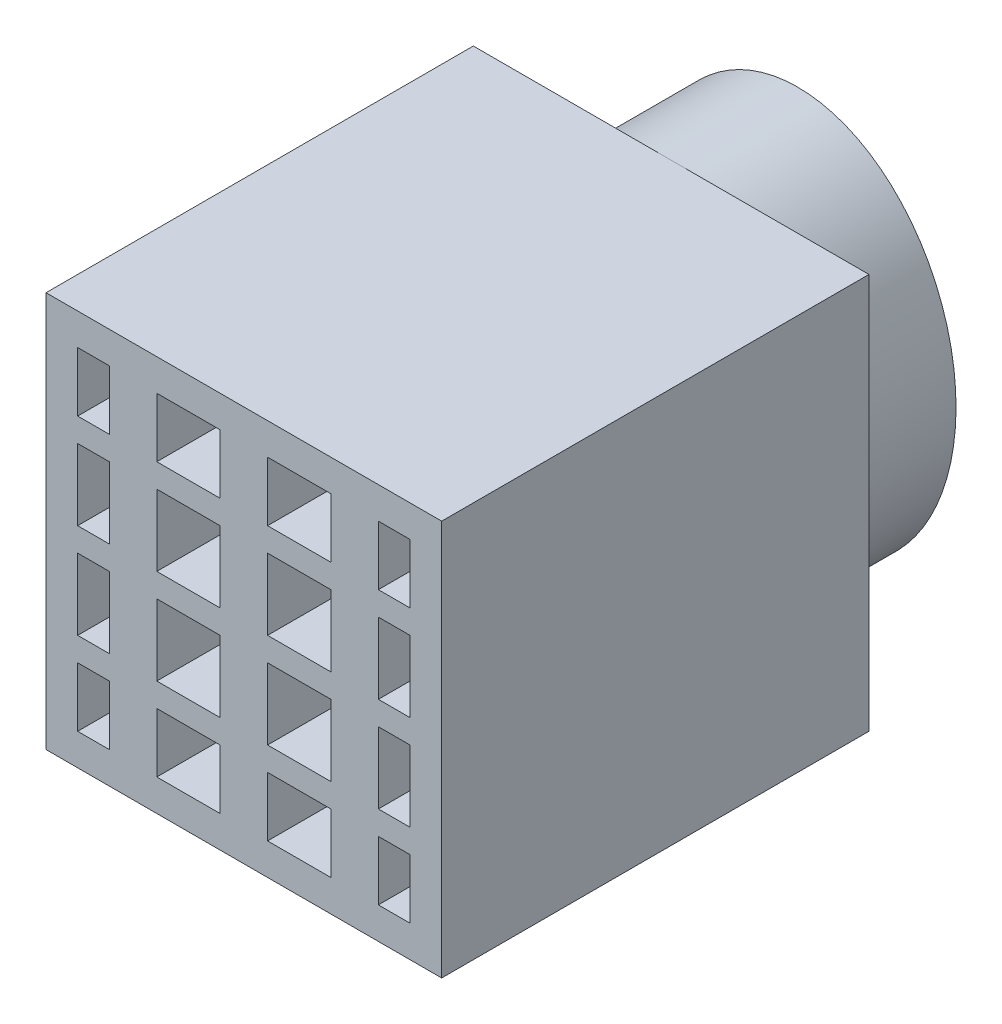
ISO-10303-21;
HEADER;
FILE_DESCRIPTION(('STEP AP214'),'2;1');
FILE_NAME('part.step','',(''),(''),'','','');
FILE_SCHEMA(('AUTOMOTIVE_DESIGN { 1 0 10303 214 1 1 1 1 }'));
ENDSEC;
DATA;
#1=APPLICATION_CONTEXT('core data for automotive mechanical design processes');
#2=APPLICATION_PROTOCOL_DEFINITION('international standard','automotive_design',2000,#1);
#3=PRODUCT_CONTEXT('',#1,'mechanical');
#4=PRODUCT('Part','Part','',(#3));
#5=PRODUCT_RELATED_PRODUCT_CATEGORY('part','',(#4));
#6=PRODUCT_DEFINITION_FORMATION('','',#4);
#7=PRODUCT_DEFINITION_CONTEXT('part definition',#1,'design');
#8=PRODUCT_DEFINITION('design','',#6,#7);
#9=PRODUCT_DEFINITION_SHAPE('','',#8);
#10=(LENGTH_UNIT() NAMED_UNIT(*) SI_UNIT(.MILLI.,.METRE.));
#11=(NAMED_UNIT(*) PLANE_ANGLE_UNIT() SI_UNIT($,.RADIAN.));
#12=(NAMED_UNIT(*) SI_UNIT($,.STERADIAN.) SOLID_ANGLE_UNIT());
#13=UNCERTAINTY_MEASURE_WITH_UNIT(LENGTH_MEASURE(1.E-05),#10,'distance_accuracy_value','');
#14=(GEOMETRIC_REPRESENTATION_CONTEXT(3) GLOBAL_UNCERTAINTY_ASSIGNED_CONTEXT((#13)) GLOBAL_UNIT_ASSIGNED_CONTEXT((#10,
#11,#12)) REPRESENTATION_CONTEXT('',''));
#15=CARTESIAN_POINT('',(0.,0.,0.));
#16=DIRECTION('',(0.,0.,1.));
#17=DIRECTION('',(1.,0.,0.));
#18=AXIS2_PLACEMENT_3D('',#15,#16,#17);
#19=CARTESIAN_POINT('',(0.,0.,-2.));
#20=DIRECTION('',(0.,0.,1.));
#21=DIRECTION('',(1.,0.,0.));
#22=AXIS2_PLACEMENT_3D('',#19,#20,#21);
#23=PLANE('',#22);
#24=CARTESIAN_POINT('',(0.,0.,-2.));
#25=DIRECTION('',(0.,0.,-1.));
#26=DIRECTION('',(0.,-1.,0.));
#27=AXIS2_PLACEMENT_3D('',#24,#25,#26);
#28=ELLIPSE('',#27,12.5,10.);
#29=CARTESIAN_POINT('',(0.,-12.5,-2.));
#30=VERTEX_POINT('',#29);
#31=CARTESIAN_POINT('',(0.,12.5,-2.));
#32=VERTEX_POINT('',#31);
#33=EDGE_CURVE('E51',#30,#32,#28,.T.);
#34=ORIENTED_EDGE('',*,*,#33,.F.);
#35=DIRECTION('',(-1.,0.,0.));
#36=VECTOR('',#35,1.);
#37=CARTESIAN_POINT('',(12.5,-12.5,-2.));
#38=LINE('',#37,#36);
#39=CARTESIAN_POINT('',(-12.5,-12.5,-2.));
#40=VERTEX_POINT('',#39);
#41=EDGE_CURVE('E479',#30,#40,#38,.T.);
#42=ORIENTED_EDGE('',*,*,#41,.T.);
#43=DIRECTION('',(0.,1.,0.));
#44=VECTOR('',#43,1.);
#45=CARTESIAN_POINT('',(-12.5,-12.5,-2.));
#46=LINE('',#45,#44);
#47=CARTESIAN_POINT('',(-12.5,12.5,-2.));
#48=VERTEX_POINT('',#47);
#49=EDGE_CURVE('E729',#40,#48,#46,.T.);
#50=ORIENTED_EDGE('',*,*,#49,.T.);
#51=DIRECTION('',(1.,0.,0.));
#52=VECTOR('',#51,1.);
#53=CARTESIAN_POINT('',(12.5,12.5,-2.));
#54=LINE('',#53,#52);
#55=EDGE_CURVE('E493',#48,#32,#54,.T.);
#56=ORIENTED_EDGE('',*,*,#55,.T.);
#57=EDGE_LOOP('',(#34,#42,#50,#56));
#58=FACE_BOUND('',#57,.T.);
#59=ADVANCED_FACE('F40',(#58),#23,.F.);
#60=CARTESIAN_POINT('',(-1.5,-10.5,25.));
#61=DIRECTION('',(-1.,0.,0.));
#62=DIRECTION('',(0.,0.,1.));
#63=AXIS2_PLACEMENT_3D('',#60,#61,#62);
#64=PLANE('',#63);
#65=DIRECTION('',(0.,0.,-1.));
#66=VECTOR('',#65,1.);
#67=CARTESIAN_POINT('',(-1.5,6.75,25.));
#68=LINE('',#67,#66);
#69=CARTESIAN_POINT('',(-1.5,6.75,25.));
#70=VERTEX_POINT('',#69);
#71=CARTESIAN_POINT('',(-1.5,6.75,0.));
#72=VERTEX_POINT('',#71);
#73=EDGE_CURVE('E590',#70,#72,#68,.T.);
#74=ORIENTED_EDGE('',*,*,#73,.F.);
#75=DIRECTION('',(0.,1.,0.));
#76=VECTOR('',#75,1.);
#77=CARTESIAN_POINT('',(-1.5,-10.5,25.));
#78=LINE('',#77,#76);
#79=CARTESIAN_POINT('',(-1.5,10.5,25.));
#80=VERTEX_POINT('',#79);
#81=EDGE_CURVE('E867',#70,#80,#78,.T.);
#82=ORIENTED_EDGE('',*,*,#81,.T.);
#83=DIRECTION('',(0.,0.,-1.));
#84=VECTOR('',#83,1.);
#85=CARTESIAN_POINT('',(-1.5,10.5,25.));
#86=LINE('',#85,#84);
#87=CARTESIAN_POINT('',(-1.5,10.5,0.));
#88=VERTEX_POINT('',#87);
#89=EDGE_CURVE('E902',#80,#88,#86,.T.);
#90=ORIENTED_EDGE('',*,*,#89,.T.);
#91=DIRECTION('',(0.,1.,0.));
#92=VECTOR('',#91,1.);
#93=CARTESIAN_POINT('',(-1.5,-10.5,0.));
#94=LINE('',#93,#92);
#95=EDGE_CURVE('E862',#72,#88,#94,.T.);
#96=ORIENTED_EDGE('',*,*,#95,.F.);
#97=EDGE_LOOP('',(#74,#82,#90,#96));
#98=FACE_BOUND('',#97,.T.);
#99=ADVANCED_FACE('F969',(#98),#64,.T.);
#100=CARTESIAN_POINT('',(-5.5,-10.5,25.));
#101=DIRECTION('',(1.,0.,0.));
#102=DIRECTION('',(0.,0.,-1.));
#103=AXIS2_PLACEMENT_3D('',#100,#101,#102);
#104=PLANE('',#103);
#105=DIRECTION('',(0.,0.,1.));
#106=VECTOR('',#105,1.);
#107=CARTESIAN_POINT('',(-5.5,6.75,25.));
#108=LINE('',#107,#106);
#109=CARTESIAN_POINT('',(-5.5,6.75,0.));
#110=VERTEX_POINT('',#109);
#111=CARTESIAN_POINT('',(-5.5,6.75,25.));
#112=VERTEX_POINT('',#111);
#113=EDGE_CURVE('E587',#110,#112,#108,.T.);
#114=ORIENTED_EDGE('',*,*,#113,.F.);
#115=DIRECTION('',(0.,-1.,0.));
#116=VECTOR('',#115,1.);
#117=CARTESIAN_POINT('',(-5.5,-10.5,0.));
#118=LINE('',#117,#116);
#119=CARTESIAN_POINT('',(-5.5,10.5,0.));
#120=VERTEX_POINT('',#119);
#121=EDGE_CURVE('E887',#120,#110,#118,.T.);
#122=ORIENTED_EDGE('',*,*,#121,.F.);
#123=DIRECTION('',(0.,0.,-1.));
#124=VECTOR('',#123,1.);
#125=CARTESIAN_POINT('',(-5.5,10.5,25.));
#126=LINE('',#125,#124);
#127=CARTESIAN_POINT('',(-5.5,10.5,25.));
#128=VERTEX_POINT('',#127);
#129=EDGE_CURVE('E900',#128,#120,#126,.T.);
#130=ORIENTED_EDGE('',*,*,#129,.F.);
#131=DIRECTION('',(0.,-1.,0.));
#132=VECTOR('',#131,1.);
#133=CARTESIAN_POINT('',(-5.5,-10.5,25.));
#134=LINE('',#133,#132);
#135=EDGE_CURVE('E871',#128,#112,#134,.T.);
#136=ORIENTED_EDGE('',*,*,#135,.T.);
#137=EDGE_LOOP('',(#114,#122,#130,#136));
#138=FACE_BOUND('',#137,.T.);
#139=ADVANCED_FACE('F982',(#138),#104,.T.);
#140=CARTESIAN_POINT('',(-8.5,-10.5,25.));
#141=DIRECTION('',(-1.,0.,0.));
#142=DIRECTION('',(0.,0.,1.));
#143=AXIS2_PLACEMENT_3D('',#140,#141,#142);
#144=PLANE('',#143);
#145=DIRECTION('',(0.,0.,-1.));
#146=VECTOR('',#145,1.);
#147=CARTESIAN_POINT('',(-8.5,6.75,25.));
#148=LINE('',#147,#146);
#149=CARTESIAN_POINT('',(-8.5,6.74999999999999,25.));
#150=VERTEX_POINT('',#149);
#151=CARTESIAN_POINT('',(-8.5,6.74999999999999,0.));
#152=VERTEX_POINT('',#151);
#153=EDGE_CURVE('E584',#150,#152,#148,.T.);
#154=ORIENTED_EDGE('',*,*,#153,.F.);
#155=DIRECTION('',(0.,1.,0.));
#156=VECTOR('',#155,1.);
#157=CARTESIAN_POINT('',(-8.5,-10.5,25.));
#158=LINE('',#157,#156);
#159=CARTESIAN_POINT('',(-8.5,10.5,25.));
#160=VERTEX_POINT('',#159);
#161=EDGE_CURVE('E824',#150,#160,#158,.T.);
#162=ORIENTED_EDGE('',*,*,#161,.T.);
#163=DIRECTION('',(0.,0.,-1.));
#164=VECTOR('',#163,1.);
#165=CARTESIAN_POINT('',(-8.5,10.5,25.));
#166=LINE('',#165,#164);
#167=CARTESIAN_POINT('',(-8.5,10.5,0.));
#168=VERTEX_POINT('',#167);
#169=EDGE_CURVE('E859',#160,#168,#166,.T.);
#170=ORIENTED_EDGE('',*,*,#169,.T.);
#171=DIRECTION('',(0.,1.,0.));
#172=VECTOR('',#171,1.);
#173=CARTESIAN_POINT('',(-8.5,-10.5,0.));
#174=LINE('',#173,#172);
#175=EDGE_CURVE('E819',#152,#168,#174,.T.);
#176=ORIENTED_EDGE('',*,*,#175,.F.);
#177=EDGE_LOOP('',(#154,#162,#170,#176));
#178=FACE_BOUND('',#177,.T.);
#179=ADVANCED_FACE('F1122',(#178),#144,.T.);
#180=CARTESIAN_POINT('',(-10.5,-10.5,25.));
#181=DIRECTION('',(1.,0.,0.));
#182=DIRECTION('',(0.,0.,-1.));
#183=AXIS2_PLACEMENT_3D('',#180,#181,#182);
#184=PLANE('',#183);
#185=DIRECTION('',(0.,0.,1.));
#186=VECTOR('',#185,1.);
#187=CARTESIAN_POINT('',(-10.5,6.75,25.));
#188=LINE('',#187,#186);
#189=CARTESIAN_POINT('',(-10.5,6.75,0.));
#190=VERTEX_POINT('',#189);
#191=CARTESIAN_POINT('',(-10.5,6.75,25.));
#192=VERTEX_POINT('',#191);
#193=EDGE_CURVE('E581',#190,#192,#188,.T.);
#194=ORIENTED_EDGE('',*,*,#193,.F.);
#195=DIRECTION('',(0.,-1.,0.));
#196=VECTOR('',#195,1.);
#197=CARTESIAN_POINT('',(-10.5,-10.5,0.));
#198=LINE('',#197,#196);
#199=CARTESIAN_POINT('',(-10.5,10.5,0.));
#200=VERTEX_POINT('',#199);
#201=EDGE_CURVE('E844',#200,#190,#198,.T.);
#202=ORIENTED_EDGE('',*,*,#201,.F.);
#203=DIRECTION('',(0.,0.,-1.));
#204=VECTOR('',#203,1.);
#205=CARTESIAN_POINT('',(-10.5,10.5,25.));
#206=LINE('',#205,#204);
#207=CARTESIAN_POINT('',(-10.5,10.5,25.));
#208=VERTEX_POINT('',#207);
#209=EDGE_CURVE('E857',#208,#200,#206,.T.);
#210=ORIENTED_EDGE('',*,*,#209,.F.);
#211=DIRECTION('',(0.,-1.,0.));
#212=VECTOR('',#211,1.);
#213=CARTESIAN_POINT('',(-10.5,-10.5,25.));
#214=LINE('',#213,#212);
#215=EDGE_CURVE('E828',#208,#192,#214,.T.);
#216=ORIENTED_EDGE('',*,*,#215,.T.);
#217=EDGE_LOOP('',(#194,#202,#210,#216));
#218=FACE_BOUND('',#217,.T.);
#219=ADVANCED_FACE('F1132',(#218),#184,.T.);
#220=CARTESIAN_POINT('',(5.5,-10.5,25.));
#221=DIRECTION('',(-1.,0.,0.));
#222=DIRECTION('',(0.,-1.,0.));
#223=AXIS2_PLACEMENT_3D('',#220,#221,#222);
#224=PLANE('',#223);
#225=DIRECTION('',(0.,0.,-1.));
#226=VECTOR('',#225,1.);
#227=CARTESIAN_POINT('',(5.5,6.75,25.));
#228=LINE('',#227,#226);
#229=CARTESIAN_POINT('',(5.5,6.75,25.));
#230=VERTEX_POINT('',#229);
#231=CARTESIAN_POINT('',(5.5,6.75,0.));
#232=VERTEX_POINT('',#231);
#233=EDGE_CURVE('E578',#230,#232,#228,.T.);
#234=ORIENTED_EDGE('',*,*,#233,.F.);
#235=DIRECTION('',(0.,1.,0.));
#236=VECTOR('',#235,1.);
#237=CARTESIAN_POINT('',(5.5,-10.5,25.));
#238=LINE('',#237,#236);
#239=CARTESIAN_POINT('',(5.5,10.5,25.));
#240=VERTEX_POINT('',#239);
#241=EDGE_CURVE('E781',#230,#240,#238,.T.);
#242=ORIENTED_EDGE('',*,*,#241,.T.);
#243=DIRECTION('',(0.,0.,-1.));
#244=VECTOR('',#243,1.);
#245=CARTESIAN_POINT('',(5.5,10.5,25.));
#246=LINE('',#245,#244);
#247=CARTESIAN_POINT('',(5.5,10.5,0.));
#248=VERTEX_POINT('',#247);
#249=EDGE_CURVE('E816',#240,#248,#246,.T.);
#250=ORIENTED_EDGE('',*,*,#249,.T.);
#251=DIRECTION('',(0.,1.,0.));
#252=VECTOR('',#251,1.);
#253=CARTESIAN_POINT('',(5.5,-10.5,0.));
#254=LINE('',#253,#252);
#255=EDGE_CURVE('E776',#232,#248,#254,.T.);
#256=ORIENTED_EDGE('',*,*,#255,.F.);
#257=EDGE_LOOP('',(#234,#242,#250,#256));
#258=FACE_BOUND('',#257,.T.);
#259=ADVANCED_FACE('F1081',(#258),#224,.T.);
#260=CARTESIAN_POINT('',(1.5,-10.5,25.));
#261=DIRECTION('',(1.,0.,0.));
#262=DIRECTION('',(0.,1.,0.));
#263=AXIS2_PLACEMENT_3D('',#260,#261,#262);
#264=PLANE('',#263);
#265=DIRECTION('',(0.,0.,1.));
#266=VECTOR('',#265,1.);
#267=CARTESIAN_POINT('',(1.5,6.75,25.));
#268=LINE('',#267,#266);
#269=CARTESIAN_POINT('',(1.5,6.75,0.));
#270=VERTEX_POINT('',#269);
#271=CARTESIAN_POINT('',(1.5,6.75,25.));
#272=VERTEX_POINT('',#271);
#273=EDGE_CURVE('E575',#270,#272,#268,.T.);
#274=ORIENTED_EDGE('',*,*,#273,.F.);
#275=DIRECTION('',(0.,-1.,0.));
#276=VECTOR('',#275,1.);
#277=CARTESIAN_POINT('',(1.5,-10.5,0.));
#278=LINE('',#277,#276);
#279=CARTESIAN_POINT('',(1.5,10.5,0.));
#280=VERTEX_POINT('',#279);
#281=EDGE_CURVE('E801',#280,#270,#278,.T.);
#282=ORIENTED_EDGE('',*,*,#281,.F.);
#283=DIRECTION('',(0.,0.,-1.));
#284=VECTOR('',#283,1.);
#285=CARTESIAN_POINT('',(1.5,10.5,25.));
#286=LINE('',#285,#284);
#287=CARTESIAN_POINT('',(1.5,10.5,25.));
#288=VERTEX_POINT('',#287);
#289=EDGE_CURVE('E814',#288,#280,#286,.T.);
#290=ORIENTED_EDGE('',*,*,#289,.F.);
#291=DIRECTION('',(0.,-1.,0.));
#292=VECTOR('',#291,1.);
#293=CARTESIAN_POINT('',(1.5,-10.5,25.));
#294=LINE('',#293,#292);
#295=EDGE_CURVE('E785',#288,#272,#294,.T.);
#296=ORIENTED_EDGE('',*,*,#295,.T.);
#297=EDGE_LOOP('',(#274,#282,#290,#296));
#298=FACE_BOUND('',#297,.T.);
#299=ADVANCED_FACE('F1206',(#298),#264,.T.);
#300=CARTESIAN_POINT('',(10.5,-10.5,25.));
#301=DIRECTION('',(-1.,0.,0.));
#302=DIRECTION('',(0.,-1.,0.));
#303=AXIS2_PLACEMENT_3D('',#300,#301,#302);
#304=PLANE('',#303);
#305=DIRECTION('',(0.,0.,-1.));
#306=VECTOR('',#305,1.);
#307=CARTESIAN_POINT('',(10.5,6.75,25.));
#308=LINE('',#307,#306);
#309=CARTESIAN_POINT('',(10.5,6.75,25.));
#310=VERTEX_POINT('',#309);
#311=CARTESIAN_POINT('',(10.5,6.75,0.));
#312=VERTEX_POINT('',#311);
#313=EDGE_CURVE('E572',#310,#312,#308,.T.);
#314=ORIENTED_EDGE('',*,*,#313,.F.);
#315=DIRECTION('',(0.,1.,0.));
#316=VECTOR('',#315,1.);
#317=CARTESIAN_POINT('',(10.5,-10.5,25.));
#318=LINE('',#317,#316);
#319=CARTESIAN_POINT('',(10.5,10.5,25.));
#320=VERTEX_POINT('',#319);
#321=EDGE_CURVE('E738',#310,#320,#318,.T.);
#322=ORIENTED_EDGE('',*,*,#321,.T.);
#323=DIRECTION('',(0.,0.,-1.));
#324=VECTOR('',#323,1.);
#325=CARTESIAN_POINT('',(10.5,10.5,25.));
#326=LINE('',#325,#324);
#327=CARTESIAN_POINT('',(10.5,10.5,0.));
#328=VERTEX_POINT('',#327);
#329=EDGE_CURVE('E773',#320,#328,#326,.T.);
#330=ORIENTED_EDGE('',*,*,#329,.T.);
#331=DIRECTION('',(0.,1.,0.));
#332=VECTOR('',#331,1.);
#333=CARTESIAN_POINT('',(10.5,-10.5,0.));
#334=LINE('',#333,#332);
#335=EDGE_CURVE('E478',#312,#328,#334,.T.);
#336=ORIENTED_EDGE('',*,*,#335,.F.);
#337=EDGE_LOOP('',(#314,#322,#330,#336));
#338=FACE_BOUND('',#337,.T.);
#339=ADVANCED_FACE('F1001',(#338),#304,.T.);
#340=CARTESIAN_POINT('',(8.5,-10.5,25.));
#341=DIRECTION('',(1.,0.,0.));
#342=DIRECTION('',(0.,1.,0.));
#343=AXIS2_PLACEMENT_3D('',#340,#341,#342);
#344=PLANE('',#343);
#345=DIRECTION('',(0.,0.,1.));
#346=VECTOR('',#345,1.);
#347=CARTESIAN_POINT('',(8.5,6.75,25.));
#348=LINE('',#347,#346);
#349=CARTESIAN_POINT('',(8.5,6.74999999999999,0.));
#350=VERTEX_POINT('',#349);
#351=CARTESIAN_POINT('',(8.5,6.74999999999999,25.));
#352=VERTEX_POINT('',#351);
#353=EDGE_CURVE('E569',#350,#352,#348,.T.);
#354=ORIENTED_EDGE('',*,*,#353,.F.);
#355=DIRECTION('',(0.,-1.,0.));
#356=VECTOR('',#355,1.);
#357=CARTESIAN_POINT('',(8.5,-10.5,0.));
#358=LINE('',#357,#356);
#359=CARTESIAN_POINT('',(8.5,10.5,0.));
#360=VERTEX_POINT('',#359);
#361=EDGE_CURVE('E758',#360,#350,#358,.T.);
#362=ORIENTED_EDGE('',*,*,#361,.F.);
#363=DIRECTION('',(0.,0.,-1.));
#364=VECTOR('',#363,1.);
#365=CARTESIAN_POINT('',(8.5,10.5,25.));
#366=LINE('',#365,#364);
#367=CARTESIAN_POINT('',(8.5,10.5,25.));
#368=VERTEX_POINT('',#367);
#369=EDGE_CURVE('E771',#368,#360,#366,.T.);
#370=ORIENTED_EDGE('',*,*,#369,.F.);
#371=DIRECTION('',(0.,-1.,0.));
#372=VECTOR('',#371,1.);
#373=CARTESIAN_POINT('',(8.5,-10.5,25.));
#374=LINE('',#373,#372);
#375=EDGE_CURVE('E742',#368,#352,#374,.T.);
#376=ORIENTED_EDGE('',*,*,#375,.T.);
#377=EDGE_LOOP('',(#354,#362,#370,#376));
#378=FACE_BOUND('',#377,.T.);
#379=ADVANCED_FACE('F1198',(#378),#344,.T.);
#380=CARTESIAN_POINT('',(0.,0.,0.));
#381=DIRECTION('',(0.,0.,1.));
#382=DIRECTION('',(1.,0.,0.));
#383=AXIS2_PLACEMENT_3D('',#380,#381,#382);
#384=PLANE('',#383);
#385=DIRECTION('',(-1.,0.,0.));
#386=VECTOR('',#385,1.);
#387=CARTESIAN_POINT('',(12.5,6.75,0.));
#388=LINE('',#387,#386);
#389=EDGE_CURVE('E536',#312,#350,#388,.T.);
#390=ORIENTED_EDGE('',*,*,#389,.F.);
#391=ORIENTED_EDGE('',*,*,#335,.T.);
#392=DIRECTION('',(-1.,0.,0.));
#393=VECTOR('',#392,1.);
#394=CARTESIAN_POINT('',(10.5,10.5,0.));
#395=LINE('',#394,#393);
#396=EDGE_CURVE('E752',#328,#360,#395,.T.);
#397=ORIENTED_EDGE('',*,*,#396,.T.);
#398=ORIENTED_EDGE('',*,*,#361,.T.);
#399=EDGE_LOOP('',(#390,#391,#397,#398));
#400=FACE_BOUND('',#399,.T.);
#401=ADVANCED_FACE('F997',(#400),#384,.T.);
#402=EDGE_CURVE('E988',#232,#270,#388,.T.);
#403=ORIENTED_EDGE('',*,*,#402,.F.);
#404=ORIENTED_EDGE('',*,*,#255,.T.);
#405=DIRECTION('',(-1.,0.,0.));
#406=VECTOR('',#405,1.);
#407=CARTESIAN_POINT('',(5.5,10.5,0.));
#408=LINE('',#407,#406);
#409=EDGE_CURVE('E795',#248,#280,#408,.T.);
#410=ORIENTED_EDGE('',*,*,#409,.T.);
#411=ORIENTED_EDGE('',*,*,#281,.T.);
#412=EDGE_LOOP('',(#403,#404,#410,#411));
#413=FACE_BOUND('',#412,.T.);
#414=ADVANCED_FACE('F1073',(#413),#384,.T.);
#415=EDGE_CURVE('E532',#152,#190,#388,.T.);
#416=ORIENTED_EDGE('',*,*,#415,.F.);
#417=ORIENTED_EDGE('',*,*,#175,.T.);
#418=DIRECTION('',(-1.,0.,0.));
#419=VECTOR('',#418,1.);
#420=CARTESIAN_POINT('',(-10.5,10.5,0.));
#421=LINE('',#420,#419);
#422=EDGE_CURVE('E838',#168,#200,#421,.T.);
#423=ORIENTED_EDGE('',*,*,#422,.T.);
#424=ORIENTED_EDGE('',*,*,#201,.T.);
#425=EDGE_LOOP('',(#416,#417,#423,#424));
#426=FACE_BOUND('',#425,.T.);
#427=ADVANCED_FACE('F1137',(#426),#384,.T.);
#428=EDGE_CURVE('E535',#72,#110,#388,.T.);
#429=ORIENTED_EDGE('',*,*,#428,.F.);
#430=ORIENTED_EDGE('',*,*,#95,.T.);
#431=DIRECTION('',(-1.,0.,0.));
#432=VECTOR('',#431,1.);
#433=CARTESIAN_POINT('',(-5.5,10.5,0.));
#434=LINE('',#433,#432);
#435=EDGE_CURVE('E881',#88,#120,#434,.T.);
#436=ORIENTED_EDGE('',*,*,#435,.T.);
#437=ORIENTED_EDGE('',*,*,#121,.T.);
#438=EDGE_LOOP('',(#429,#430,#436,#437));
#439=FACE_BOUND('',#438,.T.);
#440=ADVANCED_FACE('F1277',(#439),#384,.T.);
#441=DIRECTION('',(0.,0.,1.));
#442=VECTOR('',#441,1.);
#443=CARTESIAN_POINT('',(-1.5,-6.75,25.));
#444=LINE('',#443,#442);
#445=CARTESIAN_POINT('',(-1.5,-6.75,0.));
#446=VERTEX_POINT('',#445);
#447=CARTESIAN_POINT('',(-1.5,-6.75,25.));
#448=VERTEX_POINT('',#447);
#449=EDGE_CURVE('E658',#446,#448,#444,.T.);
#450=ORIENTED_EDGE('',*,*,#449,.F.);
#451=CARTESIAN_POINT('',(-1.5,-10.5,0.));
#452=VERTEX_POINT('',#451);
#453=EDGE_CURVE('E878',#452,#446,#94,.T.);
#454=ORIENTED_EDGE('',*,*,#453,.F.);
#455=DIRECTION('',(0.,0.,-1.));
#456=VECTOR('',#455,1.);
#457=CARTESIAN_POINT('',(-1.5,-10.5,25.));
#458=LINE('',#457,#456);
#459=CARTESIAN_POINT('',(-1.5,-10.5,25.));
#460=VERTEX_POINT('',#459);
#461=EDGE_CURVE('E877',#460,#452,#458,.T.);
#462=ORIENTED_EDGE('',*,*,#461,.F.);
#463=EDGE_CURVE('E863',#460,#448,#78,.T.);
#464=ORIENTED_EDGE('',*,*,#463,.T.);
#465=EDGE_LOOP('',(#450,#454,#462,#464));
#466=FACE_BOUND('',#465,.T.);
#467=ADVANCED_FACE('F1218',(#466),#64,.T.);
#468=DIRECTION('',(0.,0.,-1.));
#469=VECTOR('',#468,1.);
#470=CARTESIAN_POINT('',(-5.5,-6.75,25.));
#471=LINE('',#470,#469);
#472=CARTESIAN_POINT('',(-5.5,-6.75,25.));
#473=VERTEX_POINT('',#472);
#474=CARTESIAN_POINT('',(-5.5,-6.75,0.));
#475=VERTEX_POINT('',#474);
#476=EDGE_CURVE('E655',#473,#475,#471,.T.);
#477=ORIENTED_EDGE('',*,*,#476,.F.);
#478=CARTESIAN_POINT('',(-5.5,-10.5,25.));
#479=VERTEX_POINT('',#478);
#480=EDGE_CURVE('E870',#473,#479,#134,.T.);
#481=ORIENTED_EDGE('',*,*,#480,.T.);
#482=DIRECTION('',(0.,0.,-1.));
#483=VECTOR('',#482,1.);
#484=CARTESIAN_POINT('',(-5.5,-10.5,25.));
#485=LINE('',#484,#483);
#486=CARTESIAN_POINT('',(-5.5,-10.5,0.));
#487=VERTEX_POINT('',#486);
#488=EDGE_CURVE('E897',#479,#487,#485,.T.);
#489=ORIENTED_EDGE('',*,*,#488,.T.);
#490=EDGE_CURVE('E886',#475,#487,#118,.T.);
#491=ORIENTED_EDGE('',*,*,#490,.F.);
#492=EDGE_LOOP('',(#477,#481,#489,#491));
#493=FACE_BOUND('',#492,.T.);
#494=ADVANCED_FACE('F939',(#493),#104,.T.);
#495=DIRECTION('',(0.,0.,1.));
#496=VECTOR('',#495,1.);
#497=CARTESIAN_POINT('',(-8.5,-6.75,25.));
#498=LINE('',#497,#496);
#499=CARTESIAN_POINT('',(-8.5,-6.75,0.));
#500=VERTEX_POINT('',#499);
#501=CARTESIAN_POINT('',(-8.5,-6.75,25.));
#502=VERTEX_POINT('',#501);
#503=EDGE_CURVE('E652',#500,#502,#498,.T.);
#504=ORIENTED_EDGE('',*,*,#503,.F.);
#505=CARTESIAN_POINT('',(-8.5,-10.5,0.));
#506=VERTEX_POINT('',#505);
#507=EDGE_CURVE('E835',#506,#500,#174,.T.);
#508=ORIENTED_EDGE('',*,*,#507,.F.);
#509=DIRECTION('',(0.,0.,-1.));
#510=VECTOR('',#509,1.);
#511=CARTESIAN_POINT('',(-8.5,-10.5,25.));
#512=LINE('',#511,#510);
#513=CARTESIAN_POINT('',(-8.5,-10.5,25.));
#514=VERTEX_POINT('',#513);
#515=EDGE_CURVE('E834',#514,#506,#512,.T.);
#516=ORIENTED_EDGE('',*,*,#515,.F.);
#517=EDGE_CURVE('E820',#514,#502,#158,.T.);
#518=ORIENTED_EDGE('',*,*,#517,.T.);
#519=EDGE_LOOP('',(#504,#508,#516,#518));
#520=FACE_BOUND('',#519,.T.);
#521=ADVANCED_FACE('F1161',(#520),#144,.T.);
#522=DIRECTION('',(0.,0.,-1.));
#523=VECTOR('',#522,1.);
#524=CARTESIAN_POINT('',(-10.5,-6.75,25.));
#525=LINE('',#524,#523);
#526=CARTESIAN_POINT('',(-10.5,-6.75,25.));
#527=VERTEX_POINT('',#526);
#528=CARTESIAN_POINT('',(-10.5,-6.75,0.));
#529=VERTEX_POINT('',#528);
#530=EDGE_CURVE('E649',#527,#529,#525,.T.);
#531=ORIENTED_EDGE('',*,*,#530,.F.);
#532=CARTESIAN_POINT('',(-10.5,-10.5,25.));
#533=VERTEX_POINT('',#532);
#534=EDGE_CURVE('E827',#527,#533,#214,.T.);
#535=ORIENTED_EDGE('',*,*,#534,.T.);
#536=DIRECTION('',(0.,0.,-1.));
#537=VECTOR('',#536,1.);
#538=CARTESIAN_POINT('',(-10.5,-10.5,25.));
#539=LINE('',#538,#537);
#540=CARTESIAN_POINT('',(-10.5,-10.5,0.));
#541=VERTEX_POINT('',#540);
#542=EDGE_CURVE('E854',#533,#541,#539,.T.);
#543=ORIENTED_EDGE('',*,*,#542,.T.);
#544=EDGE_CURVE('E843',#529,#541,#198,.T.);
#545=ORIENTED_EDGE('',*,*,#544,.F.);
#546=EDGE_LOOP('',(#531,#535,#543,#545));
#547=FACE_BOUND('',#546,.T.);
#548=ADVANCED_FACE('F1149',(#547),#184,.T.);
#549=DIRECTION('',(0.,0.,1.));
#550=VECTOR('',#549,1.);
#551=CARTESIAN_POINT('',(5.5,-6.75,25.));
#552=LINE('',#551,#550);
#553=CARTESIAN_POINT('',(5.5,-6.75,0.));
#554=VERTEX_POINT('',#553);
#555=CARTESIAN_POINT('',(5.5,-6.75,25.));
#556=VERTEX_POINT('',#555);
#557=EDGE_CURVE('E646',#554,#556,#552,.T.);
#558=ORIENTED_EDGE('',*,*,#557,.F.);
#559=CARTESIAN_POINT('',(5.5,-10.5,0.));
#560=VERTEX_POINT('',#559);
#561=EDGE_CURVE('E792',#560,#554,#254,.T.);
#562=ORIENTED_EDGE('',*,*,#561,.F.);
#563=DIRECTION('',(0.,0.,-1.));
#564=VECTOR('',#563,1.);
#565=CARTESIAN_POINT('',(5.5,-10.5,25.));
#566=LINE('',#565,#564);
#567=CARTESIAN_POINT('',(5.5,-10.5,25.));
#568=VERTEX_POINT('',#567);
#569=EDGE_CURVE('E791',#568,#560,#566,.T.);
#570=ORIENTED_EDGE('',*,*,#569,.F.);
#571=EDGE_CURVE('E777',#568,#556,#238,.T.);
#572=ORIENTED_EDGE('',*,*,#571,.T.);
#573=EDGE_LOOP('',(#558,#562,#570,#572));
#574=FACE_BOUND('',#573,.T.);
#575=ADVANCED_FACE('F1513',(#574),#224,.T.);
#576=DIRECTION('',(0.,0.,-1.));
#577=VECTOR('',#576,1.);
#578=CARTESIAN_POINT('',(1.5,-6.75,25.));
#579=LINE('',#578,#577);
#580=CARTESIAN_POINT('',(1.5,-6.75,25.));
#581=VERTEX_POINT('',#580);
#582=CARTESIAN_POINT('',(1.5,-6.75,0.));
#583=VERTEX_POINT('',#582);
#584=EDGE_CURVE('E643',#581,#583,#579,.T.);
#585=ORIENTED_EDGE('',*,*,#584,.F.);
#586=CARTESIAN_POINT('',(1.5,-10.5,25.));
#587=VERTEX_POINT('',#586);
#588=EDGE_CURVE('E784',#581,#587,#294,.T.);
#589=ORIENTED_EDGE('',*,*,#588,.T.);
#590=DIRECTION('',(0.,0.,-1.));
#591=VECTOR('',#590,1.);
#592=CARTESIAN_POINT('',(1.5,-10.5,25.));
#593=LINE('',#592,#591);
#594=CARTESIAN_POINT('',(1.5,-10.5,0.));
#595=VERTEX_POINT('',#594);
#596=EDGE_CURVE('E811',#587,#595,#593,.T.);
#597=ORIENTED_EDGE('',*,*,#596,.T.);
#598=EDGE_CURVE('E800',#583,#595,#278,.T.);
#599=ORIENTED_EDGE('',*,*,#598,.F.);
#600=EDGE_LOOP('',(#585,#589,#597,#599));
#601=FACE_BOUND('',#600,.T.);
#602=ADVANCED_FACE('F1176',(#601),#264,.T.);
#603=DIRECTION('',(0.,0.,1.));
#604=VECTOR('',#603,1.);
#605=CARTESIAN_POINT('',(10.5,-6.75,25.));
#606=LINE('',#605,#604);
#607=CARTESIAN_POINT('',(10.5,-6.75,0.));
#608=VERTEX_POINT('',#607);
#609=CARTESIAN_POINT('',(10.5,-6.75,25.));
#610=VERTEX_POINT('',#609);
#611=EDGE_CURVE('E640',#608,#610,#606,.T.);
#612=ORIENTED_EDGE('',*,*,#611,.F.);
#613=CARTESIAN_POINT('',(10.5,-10.5,0.));
#614=VERTEX_POINT('',#613);
#615=EDGE_CURVE('E749',#614,#608,#334,.T.);
#616=ORIENTED_EDGE('',*,*,#615,.F.);
#617=DIRECTION('',(0.,0.,-1.));
#618=VECTOR('',#617,1.);
#619=CARTESIAN_POINT('',(10.5,-10.5,25.));
#620=LINE('',#619,#618);
#621=CARTESIAN_POINT('',(10.5,-10.5,25.));
#622=VERTEX_POINT('',#621);
#623=EDGE_CURVE('E748',#622,#614,#620,.T.);
#624=ORIENTED_EDGE('',*,*,#623,.F.);
#625=EDGE_CURVE('E734',#622,#610,#318,.T.);
#626=ORIENTED_EDGE('',*,*,#625,.T.);
#627=EDGE_LOOP('',(#612,#616,#624,#626));
#628=FACE_BOUND('',#627,.T.);
#629=ADVANCED_FACE('F1039',(#628),#304,.T.);
#630=DIRECTION('',(0.,0.,-1.));
#631=VECTOR('',#630,1.);
#632=CARTESIAN_POINT('',(8.5,-6.75,25.));
#633=LINE('',#632,#631);
#634=CARTESIAN_POINT('',(8.5,-6.75,25.));
#635=VERTEX_POINT('',#634);
#636=CARTESIAN_POINT('',(8.5,-6.75,0.));
#637=VERTEX_POINT('',#636);
#638=EDGE_CURVE('E637',#635,#637,#633,.T.);
#639=ORIENTED_EDGE('',*,*,#638,.F.);
#640=CARTESIAN_POINT('',(8.5,-10.5,25.));
#641=VERTEX_POINT('',#640);
#642=EDGE_CURVE('E741',#635,#641,#374,.T.);
#643=ORIENTED_EDGE('',*,*,#642,.T.);
#644=DIRECTION('',(0.,0.,-1.));
#645=VECTOR('',#644,1.);
#646=CARTESIAN_POINT('',(8.5,-10.5,25.));
#647=LINE('',#646,#645);
#648=CARTESIAN_POINT('',(8.5,-10.5,0.));
#649=VERTEX_POINT('',#648);
#650=EDGE_CURVE('E768',#641,#649,#647,.T.);
#651=ORIENTED_EDGE('',*,*,#650,.T.);
#652=EDGE_CURVE('E757',#637,#649,#358,.T.);
#653=ORIENTED_EDGE('',*,*,#652,.F.);
#654=EDGE_LOOP('',(#639,#643,#651,#653));
#655=FACE_BOUND('',#654,.T.);
#656=ADVANCED_FACE('F1027',(#655),#344,.T.);
#657=DIRECTION('',(1.,0.,0.));
#658=VECTOR('',#657,1.);
#659=CARTESIAN_POINT('',(12.5,-6.75,0.));
#660=LINE('',#659,#658);
#661=EDGE_CURVE('E600',#637,#608,#660,.T.);
#662=ORIENTED_EDGE('',*,*,#661,.F.);
#663=ORIENTED_EDGE('',*,*,#652,.T.);
#664=DIRECTION('',(1.,0.,0.));
#665=VECTOR('',#664,1.);
#666=CARTESIAN_POINT('',(10.5,-10.5,0.));
#667=LINE('',#666,#665);
#668=EDGE_CURVE('E761',#649,#614,#667,.T.);
#669=ORIENTED_EDGE('',*,*,#668,.T.);
#670=ORIENTED_EDGE('',*,*,#615,.T.);
#671=EDGE_LOOP('',(#662,#663,#669,#670));
#672=FACE_BOUND('',#671,.T.);
#673=ADVANCED_FACE('F1043',(#672),#384,.T.);
#674=EDGE_CURVE('E603',#583,#554,#660,.T.);
#675=ORIENTED_EDGE('',*,*,#674,.F.);
#676=ORIENTED_EDGE('',*,*,#598,.T.);
#677=DIRECTION('',(1.,0.,0.));
#678=VECTOR('',#677,1.);
#679=CARTESIAN_POINT('',(5.5,-10.5,0.));
#680=LINE('',#679,#678);
#681=EDGE_CURVE('E804',#595,#560,#680,.T.);
#682=ORIENTED_EDGE('',*,*,#681,.T.);
#683=ORIENTED_EDGE('',*,*,#561,.T.);
#684=EDGE_LOOP('',(#675,#676,#682,#683));
#685=FACE_BOUND('',#684,.T.);
#686=ADVANCED_FACE('F1173',(#685),#384,.T.);
#687=EDGE_CURVE('E604',#529,#500,#660,.T.);
#688=ORIENTED_EDGE('',*,*,#687,.F.);
#689=ORIENTED_EDGE('',*,*,#544,.T.);
#690=DIRECTION('',(1.,0.,0.));
#691=VECTOR('',#690,1.);
#692=CARTESIAN_POINT('',(-10.5,-10.5,0.));
#693=LINE('',#692,#691);
#694=EDGE_CURVE('E847',#541,#506,#693,.T.);
#695=ORIENTED_EDGE('',*,*,#694,.T.);
#696=ORIENTED_EDGE('',*,*,#507,.T.);
#697=EDGE_LOOP('',(#688,#689,#695,#696));
#698=FACE_BOUND('',#697,.T.);
#699=ADVANCED_FACE('F1291',(#698),#384,.T.);
#700=DIRECTION('',(1.,0.,0.));
#701=VECTOR('',#700,1.);
#702=CARTESIAN_POINT('',(0.,-6.75,0.));
#703=LINE('',#702,#701);
#704=EDGE_CURVE('E44',#475,#446,#703,.T.);
#705=ORIENTED_EDGE('',*,*,#704,.F.);
#706=ORIENTED_EDGE('',*,*,#490,.T.);
#707=DIRECTION('',(1.,0.,0.));
#708=VECTOR('',#707,1.);
#709=CARTESIAN_POINT('',(-5.5,-10.5,0.));
#710=LINE('',#709,#708);
#711=EDGE_CURVE('E890',#487,#452,#710,.T.);
#712=ORIENTED_EDGE('',*,*,#711,.T.);
#713=ORIENTED_EDGE('',*,*,#453,.T.);
#714=EDGE_LOOP('',(#705,#706,#712,#713));
#715=FACE_BOUND('',#714,.T.);
#716=ADVANCED_FACE('F936',(#715),#384,.T.);
#717=DIRECTION('',(0.,0.,1.));
#718=VECTOR('',#717,1.);
#719=CARTESIAN_POINT('',(-1.5,5.25,25.));
#720=LINE('',#719,#718);
#721=CARTESIAN_POINT('',(-1.5,5.25,0.));
#722=VERTEX_POINT('',#721);
#723=CARTESIAN_POINT('',(-1.5,5.25,25.));
#724=VERTEX_POINT('',#723);
#725=EDGE_CURVE('E566',#722,#724,#720,.T.);
#726=ORIENTED_EDGE('',*,*,#725,.F.);
#727=CARTESIAN_POINT('',(-1.5,0.750000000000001,0.));
#728=VERTEX_POINT('',#727);
#729=EDGE_CURVE('E883',#728,#722,#94,.T.);
#730=ORIENTED_EDGE('',*,*,#729,.F.);
#731=DIRECTION('',(0.,0.,-1.));
#732=VECTOR('',#731,1.);
#733=CARTESIAN_POINT('',(-1.5,0.750000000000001,25.));
#734=LINE('',#733,#732);
#735=CARTESIAN_POINT('',(-1.5,0.750000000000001,25.));
#736=VERTEX_POINT('',#735);
#737=EDGE_CURVE('E726',#736,#728,#734,.T.);
#738=ORIENTED_EDGE('',*,*,#737,.F.);
#739=EDGE_CURVE('E868',#736,#724,#78,.T.);
#740=ORIENTED_EDGE('',*,*,#739,.T.);
#741=EDGE_LOOP('',(#726,#730,#738,#740));
#742=FACE_BOUND('',#741,.T.);
#743=ADVANCED_FACE('F959',(#742),#64,.T.);
#744=DIRECTION('',(0.,0.,-1.));
#745=VECTOR('',#744,1.);
#746=CARTESIAN_POINT('',(-5.5,5.25,25.));
#747=LINE('',#746,#745);
#748=CARTESIAN_POINT('',(-5.5,5.25,25.));
#749=VERTEX_POINT('',#748);
#750=CARTESIAN_POINT('',(-5.5,5.25,0.));
#751=VERTEX_POINT('',#750);
#752=EDGE_CURVE('E563',#749,#751,#747,.T.);
#753=ORIENTED_EDGE('',*,*,#752,.F.);
#754=CARTESIAN_POINT('',(-5.5,0.750000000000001,25.));
#755=VERTEX_POINT('',#754);
#756=EDGE_CURVE('E874',#749,#755,#134,.T.);
#757=ORIENTED_EDGE('',*,*,#756,.T.);
#758=DIRECTION('',(0.,0.,1.));
#759=VECTOR('',#758,1.);
#760=CARTESIAN_POINT('',(-5.5,0.750000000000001,25.));
#761=LINE('',#760,#759);
#762=CARTESIAN_POINT('',(-5.5,0.750000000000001,0.));
#763=VERTEX_POINT('',#762);
#764=EDGE_CURVE('E723',#763,#755,#761,.T.);
#765=ORIENTED_EDGE('',*,*,#764,.F.);
#766=EDGE_CURVE('E891',#751,#763,#118,.T.);
#767=ORIENTED_EDGE('',*,*,#766,.F.);
#768=EDGE_LOOP('',(#753,#757,#765,#767));
#769=FACE_BOUND('',#768,.T.);
#770=ADVANCED_FACE('F950',(#769),#104,.T.);
#771=DIRECTION('',(0.,0.,1.));
#772=VECTOR('',#771,1.);
#773=CARTESIAN_POINT('',(-8.5,5.25,25.));
#774=LINE('',#773,#772);
#775=CARTESIAN_POINT('',(-8.49999999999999,5.25,0.));
#776=VERTEX_POINT('',#775);
#777=CARTESIAN_POINT('',(-8.5,5.24999999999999,25.));
#778=VERTEX_POINT('',#777);
#779=EDGE_CURVE('E560',#776,#778,#774,.T.);
#780=ORIENTED_EDGE('',*,*,#779,.F.);
#781=CARTESIAN_POINT('',(-8.5,0.749999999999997,0.));
#782=VERTEX_POINT('',#781);
#783=EDGE_CURVE('E840',#782,#776,#174,.T.);
#784=ORIENTED_EDGE('',*,*,#783,.F.);
#785=DIRECTION('',(0.,0.,-1.));
#786=VECTOR('',#785,1.);
#787=CARTESIAN_POINT('',(-8.5,0.750000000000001,25.));
#788=LINE('',#787,#786);
#789=CARTESIAN_POINT('',(-8.5,0.749999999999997,25.));
#790=VERTEX_POINT('',#789);
#791=EDGE_CURVE('E720',#790,#782,#788,.T.);
#792=ORIENTED_EDGE('',*,*,#791,.F.);
#793=EDGE_CURVE('E825',#790,#778,#158,.T.);
#794=ORIENTED_EDGE('',*,*,#793,.T.);
#795=EDGE_LOOP('',(#780,#784,#792,#794));
#796=FACE_BOUND('',#795,.T.);
#797=ADVANCED_FACE('F1289',(#796),#144,.T.);
#798=DIRECTION('',(0.,0.,-1.));
#799=VECTOR('',#798,1.);
#800=CARTESIAN_POINT('',(-10.5,5.25,25.));
#801=LINE('',#800,#799);
#802=CARTESIAN_POINT('',(-10.5,5.25,25.));
#803=VERTEX_POINT('',#802);
#804=CARTESIAN_POINT('',(-10.5,5.25,0.));
#805=VERTEX_POINT('',#804);
#806=EDGE_CURVE('E557',#803,#805,#801,.T.);
#807=ORIENTED_EDGE('',*,*,#806,.F.);
#808=CARTESIAN_POINT('',(-10.5,0.750000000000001,25.));
#809=VERTEX_POINT('',#808);
#810=EDGE_CURVE('E831',#803,#809,#214,.T.);
#811=ORIENTED_EDGE('',*,*,#810,.T.);
#812=DIRECTION('',(0.,0.,1.));
#813=VECTOR('',#812,1.);
#814=CARTESIAN_POINT('',(-10.5,0.750000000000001,25.));
#815=LINE('',#814,#813);
#816=CARTESIAN_POINT('',(-10.5,0.750000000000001,0.));
#817=VERTEX_POINT('',#816);
#818=EDGE_CURVE('E717',#817,#809,#815,.T.);
#819=ORIENTED_EDGE('',*,*,#818,.F.);
#820=EDGE_CURVE('E848',#805,#817,#198,.T.);
#821=ORIENTED_EDGE('',*,*,#820,.F.);
#822=EDGE_LOOP('',(#807,#811,#819,#821));
#823=FACE_BOUND('',#822,.T.);
#824=ADVANCED_FACE('F1254',(#823),#184,.T.);
#825=DIRECTION('',(0.,0.,1.));
#826=VECTOR('',#825,1.);
#827=CARTESIAN_POINT('',(5.5,5.25,25.));
#828=LINE('',#827,#826);
#829=CARTESIAN_POINT('',(5.5,5.25,0.));
#830=VERTEX_POINT('',#829);
#831=CARTESIAN_POINT('',(5.5,5.25,25.));
#832=VERTEX_POINT('',#831);
#833=EDGE_CURVE('E554',#830,#832,#828,.T.);
#834=ORIENTED_EDGE('',*,*,#833,.F.);
#835=CARTESIAN_POINT('',(5.5,0.750000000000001,0.));
#836=VERTEX_POINT('',#835);
#837=EDGE_CURVE('E797',#836,#830,#254,.T.);
#838=ORIENTED_EDGE('',*,*,#837,.F.);
#839=DIRECTION('',(0.,0.,-1.));
#840=VECTOR('',#839,1.);
#841=CARTESIAN_POINT('',(5.5,0.750000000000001,25.));
#842=LINE('',#841,#840);
#843=CARTESIAN_POINT('',(5.5,0.750000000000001,25.));
#844=VERTEX_POINT('',#843);
#845=EDGE_CURVE('E714',#844,#836,#842,.T.);
#846=ORIENTED_EDGE('',*,*,#845,.F.);
#847=EDGE_CURVE('E782',#844,#832,#238,.T.);
#848=ORIENTED_EDGE('',*,*,#847,.T.);
#849=EDGE_LOOP('',(#834,#838,#846,#848));
#850=FACE_BOUND('',#849,.T.);
#851=ADVANCED_FACE('F1067',(#850),#224,.T.);
#852=DIRECTION('',(0.,0.,-1.));
#853=VECTOR('',#852,1.);
#854=CARTESIAN_POINT('',(1.5,5.25,25.));
#855=LINE('',#854,#853);
#856=CARTESIAN_POINT('',(1.5,5.25,25.));
#857=VERTEX_POINT('',#856);
#858=CARTESIAN_POINT('',(1.5,5.25,0.));
#859=VERTEX_POINT('',#858);
#860=EDGE_CURVE('E551',#857,#859,#855,.T.);
#861=ORIENTED_EDGE('',*,*,#860,.F.);
#862=CARTESIAN_POINT('',(1.5,0.750000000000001,25.));
#863=VERTEX_POINT('',#862);
#864=EDGE_CURVE('E788',#857,#863,#294,.T.);
#865=ORIENTED_EDGE('',*,*,#864,.T.);
#866=DIRECTION('',(0.,0.,1.));
#867=VECTOR('',#866,1.);
#868=CARTESIAN_POINT('',(1.5,0.750000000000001,25.));
#869=LINE('',#868,#867);
#870=CARTESIAN_POINT('',(1.5,0.750000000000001,0.));
#871=VERTEX_POINT('',#870);
#872=EDGE_CURVE('E711',#871,#863,#869,.T.);
#873=ORIENTED_EDGE('',*,*,#872,.F.);
#874=EDGE_CURVE('E805',#859,#871,#278,.T.);
#875=ORIENTED_EDGE('',*,*,#874,.F.);
#876=EDGE_LOOP('',(#861,#865,#873,#875));
#877=FACE_BOUND('',#876,.T.);
#878=ADVANCED_FACE('F1496',(#877),#264,.T.);
#879=DIRECTION('',(0.,0.,1.));
#880=VECTOR('',#879,1.);
#881=CARTESIAN_POINT('',(10.5,5.25,25.));
#882=LINE('',#881,#880);
#883=CARTESIAN_POINT('',(10.5,5.25,0.));
#884=VERTEX_POINT('',#883);
#885=CARTESIAN_POINT('',(10.5,5.25,25.));
#886=VERTEX_POINT('',#885);
#887=EDGE_CURVE('E548',#884,#886,#882,.T.);
#888=ORIENTED_EDGE('',*,*,#887,.F.);
#889=CARTESIAN_POINT('',(10.5,0.750000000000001,0.));
#890=VERTEX_POINT('',#889);
#891=EDGE_CURVE('E754',#890,#884,#334,.T.);
#892=ORIENTED_EDGE('',*,*,#891,.F.);
#893=DIRECTION('',(0.,0.,-1.));
#894=VECTOR('',#893,1.);
#895=CARTESIAN_POINT('',(10.5,0.750000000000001,25.));
#896=LINE('',#895,#894);
#897=CARTESIAN_POINT('',(10.5,0.750000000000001,25.));
#898=VERTEX_POINT('',#897);
#899=EDGE_CURVE('E708',#898,#890,#896,.T.);
#900=ORIENTED_EDGE('',*,*,#899,.F.);
#901=EDGE_CURVE('E739',#898,#886,#318,.T.);
#902=ORIENTED_EDGE('',*,*,#901,.T.);
#903=EDGE_LOOP('',(#888,#892,#900,#902));
#904=FACE_BOUND('',#903,.T.);
#905=ADVANCED_FACE('F1489',(#904),#304,.T.);
#906=DIRECTION('',(0.,0.,-1.));
#907=VECTOR('',#906,1.);
#908=CARTESIAN_POINT('',(8.5,5.25,25.));
#909=LINE('',#908,#907);
#910=CARTESIAN_POINT('',(8.5,5.24999999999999,25.));
#911=VERTEX_POINT('',#910);
#912=CARTESIAN_POINT('',(8.5,5.24999999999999,0.));
#913=VERTEX_POINT('',#912);
#914=EDGE_CURVE('E545',#911,#913,#909,.T.);
#915=ORIENTED_EDGE('',*,*,#914,.F.);
#916=CARTESIAN_POINT('',(8.5,0.749999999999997,25.));
#917=VERTEX_POINT('',#916);
#918=EDGE_CURVE('E745',#911,#917,#374,.T.);
#919=ORIENTED_EDGE('',*,*,#918,.T.);
#920=DIRECTION('',(0.,0.,1.));
#921=VECTOR('',#920,1.);
#922=CARTESIAN_POINT('',(8.5,0.750000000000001,25.));
#923=LINE('',#922,#921);
#924=CARTESIAN_POINT('',(8.5,0.749999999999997,0.));
#925=VERTEX_POINT('',#924);
#926=EDGE_CURVE('E705',#925,#917,#923,.T.);
#927=ORIENTED_EDGE('',*,*,#926,.F.);
#928=EDGE_CURVE('E762',#913,#925,#358,.T.);
#929=ORIENTED_EDGE('',*,*,#928,.F.);
#930=EDGE_LOOP('',(#915,#919,#927,#929));
#931=FACE_BOUND('',#930,.T.);
#932=ADVANCED_FACE('F1049',(#931),#344,.T.);
#933=DIRECTION('',(1.,0.,0.));
#934=VECTOR('',#933,1.);
#935=CARTESIAN_POINT('',(12.5,5.25,0.));
#936=LINE('',#935,#934);
#937=EDGE_CURVE('E64',#913,#884,#936,.T.);
#938=ORIENTED_EDGE('',*,*,#937,.F.);
#939=ORIENTED_EDGE('',*,*,#928,.T.);
#940=DIRECTION('',(-1.,0.,0.));
#941=VECTOR('',#940,1.);
#942=CARTESIAN_POINT('',(12.5,0.75,0.));
#943=LINE('',#942,#941);
#944=EDGE_CURVE('E672',#890,#925,#943,.T.);
#945=ORIENTED_EDGE('',*,*,#944,.F.);
#946=ORIENTED_EDGE('',*,*,#891,.T.);
#947=EDGE_LOOP('',(#938,#939,#945,#946));
#948=FACE_BOUND('',#947,.T.);
#949=ADVANCED_FACE('F1045',(#948),#384,.T.);
#950=EDGE_CURVE('E529',#859,#830,#936,.T.);
#951=ORIENTED_EDGE('',*,*,#950,.F.);
#952=ORIENTED_EDGE('',*,*,#874,.T.);
#953=EDGE_CURVE('E671',#836,#871,#943,.T.);
#954=ORIENTED_EDGE('',*,*,#953,.F.);
#955=ORIENTED_EDGE('',*,*,#837,.T.);
#956=EDGE_LOOP('',(#951,#952,#954,#955));
#957=FACE_BOUND('',#956,.T.);
#958=ADVANCED_FACE('F1063',(#957),#384,.T.);
#959=EDGE_CURVE('E531',#805,#776,#936,.T.);
#960=ORIENTED_EDGE('',*,*,#959,.F.);
#961=ORIENTED_EDGE('',*,*,#820,.T.);
#962=EDGE_CURVE('E668',#782,#817,#943,.T.);
#963=ORIENTED_EDGE('',*,*,#962,.F.);
#964=ORIENTED_EDGE('',*,*,#783,.T.);
#965=EDGE_LOOP('',(#960,#961,#963,#964));
#966=FACE_BOUND('',#965,.T.);
#967=ADVANCED_FACE('F1237',(#966),#384,.T.);
#968=EDGE_CURVE('E948',#751,#722,#936,.T.);
#969=ORIENTED_EDGE('',*,*,#968,.F.);
#970=ORIENTED_EDGE('',*,*,#766,.T.);
#971=DIRECTION('',(-1.,0.,0.));
#972=VECTOR('',#971,1.);
#973=CARTESIAN_POINT('',(0.,0.75,0.));
#974=LINE('',#973,#972);
#975=EDGE_CURVE('E924',#728,#763,#974,.T.);
#976=ORIENTED_EDGE('',*,*,#975,.F.);
#977=ORIENTED_EDGE('',*,*,#729,.T.);
#978=EDGE_LOOP('',(#969,#970,#976,#977));
#979=FACE_BOUND('',#978,.T.);
#980=ADVANCED_FACE('F945',(#979),#384,.T.);
#981=CARTESIAN_POINT('',(0.,0.,25.));
#982=DIRECTION('',(0.,0.,-1.));
#983=DIRECTION('',(-1.,0.,0.));
#984=AXIS2_PLACEMENT_3D('',#981,#982,#983);
#985=PLANE('',#984);
#986=ORIENTED_EDGE('',*,*,#81,.F.);
#987=DIRECTION('',(-1.,0.,0.));
#988=VECTOR('',#987,1.);
#989=CARTESIAN_POINT('',(12.5,6.75,25.));
#990=LINE('',#989,#988);
#991=EDGE_CURVE('E544',#70,#112,#990,.T.);
#992=ORIENTED_EDGE('',*,*,#991,.T.);
#993=ORIENTED_EDGE('',*,*,#135,.F.);
#994=DIRECTION('',(-1.,0.,0.));
#995=VECTOR('',#994,1.);
#996=CARTESIAN_POINT('',(-5.5,10.5,25.));
#997=LINE('',#996,#995);
#998=EDGE_CURVE('E865',#80,#128,#997,.T.);
#999=ORIENTED_EDGE('',*,*,#998,.F.);
#1000=EDGE_LOOP('',(#986,#992,#993,#999));
#1001=FACE_BOUND('',#1000,.T.);
#1002=ORIENTED_EDGE('',*,*,#161,.F.);
#1003=EDGE_CURVE('E541',#150,#192,#990,.T.);
#1004=ORIENTED_EDGE('',*,*,#1003,.T.);
#1005=ORIENTED_EDGE('',*,*,#215,.F.);
#1006=DIRECTION('',(-1.,0.,0.));
#1007=VECTOR('',#1006,1.);
#1008=CARTESIAN_POINT('',(-10.5,10.5,25.));
#1009=LINE('',#1008,#1007);
#1010=EDGE_CURVE('E822',#160,#208,#1009,.T.);
#1011=ORIENTED_EDGE('',*,*,#1010,.F.);
#1012=EDGE_LOOP('',(#1002,#1004,#1005,#1011));
#1013=FACE_BOUND('',#1012,.T.);
#1014=ORIENTED_EDGE('',*,*,#241,.F.);
#1015=EDGE_CURVE('E1952',#230,#272,#990,.T.);
#1016=ORIENTED_EDGE('',*,*,#1015,.T.);
#1017=ORIENTED_EDGE('',*,*,#295,.F.);
#1018=DIRECTION('',(-1.,0.,0.));
#1019=VECTOR('',#1018,1.);
#1020=CARTESIAN_POINT('',(5.5,10.5,25.));
#1021=LINE('',#1020,#1019);
#1022=EDGE_CURVE('E779',#240,#288,#1021,.T.);
#1023=ORIENTED_EDGE('',*,*,#1022,.F.);
#1024=EDGE_LOOP('',(#1014,#1016,#1017,#1023));
#1025=FACE_BOUND('',#1024,.T.);
#1026=ORIENTED_EDGE('',*,*,#321,.F.);
#1027=EDGE_CURVE('E530',#310,#352,#990,.T.);
#1028=ORIENTED_EDGE('',*,*,#1027,.T.);
#1029=ORIENTED_EDGE('',*,*,#375,.F.);
#1030=DIRECTION('',(-1.,0.,0.));
#1031=VECTOR('',#1030,1.);
#1032=CARTESIAN_POINT('',(10.5,10.5,25.));
#1033=LINE('',#1032,#1031);
#1034=EDGE_CURVE('E736',#320,#368,#1033,.T.);
#1035=ORIENTED_EDGE('',*,*,#1034,.F.);
#1036=EDGE_LOOP('',(#1026,#1028,#1029,#1035));
#1037=FACE_BOUND('',#1036,.T.);
#1038=ORIENTED_EDGE('',*,*,#810,.F.);
#1039=DIRECTION('',(1.,0.,0.));
#1040=VECTOR('',#1039,1.);
#1041=CARTESIAN_POINT('',(12.5,5.25,25.));
#1042=LINE('',#1041,#1040);
#1043=EDGE_CURVE('E540',#803,#778,#1042,.T.);
#1044=ORIENTED_EDGE('',*,*,#1043,.T.);
#1045=ORIENTED_EDGE('',*,*,#793,.F.);
#1046=DIRECTION('',(-1.,0.,0.));
#1047=VECTOR('',#1046,1.);
#1048=CARTESIAN_POINT('',(12.5,0.75,25.));
#1049=LINE('',#1048,#1047);
#1050=EDGE_CURVE('E677',#790,#809,#1049,.T.);
#1051=ORIENTED_EDGE('',*,*,#1050,.T.);
#1052=EDGE_LOOP('',(#1038,#1044,#1045,#1051));
#1053=FACE_BOUND('',#1052,.T.);
#1054=ORIENTED_EDGE('',*,*,#756,.F.);
#1055=EDGE_CURVE('E965',#749,#724,#1042,.T.);
#1056=ORIENTED_EDGE('',*,*,#1055,.T.);
#1057=ORIENTED_EDGE('',*,*,#739,.F.);
#1058=EDGE_CURVE('E680',#736,#755,#1049,.T.);
#1059=ORIENTED_EDGE('',*,*,#1058,.T.);
#1060=EDGE_LOOP('',(#1054,#1056,#1057,#1059));
#1061=FACE_BOUND('',#1060,.T.);
#1062=ORIENTED_EDGE('',*,*,#864,.F.);
#1063=EDGE_CURVE('E539',#857,#832,#1042,.T.);
#1064=ORIENTED_EDGE('',*,*,#1063,.T.);
#1065=ORIENTED_EDGE('',*,*,#847,.F.);
#1066=EDGE_CURVE('E1981',#844,#863,#1049,.T.);
#1067=ORIENTED_EDGE('',*,*,#1066,.T.);
#1068=EDGE_LOOP('',(#1062,#1064,#1065,#1067));
#1069=FACE_BOUND('',#1068,.T.);
#1070=ORIENTED_EDGE('',*,*,#918,.F.);
#1071=EDGE_CURVE('E495',#911,#886,#1042,.T.);
#1072=ORIENTED_EDGE('',*,*,#1071,.T.);
#1073=ORIENTED_EDGE('',*,*,#901,.F.);
#1074=EDGE_CURVE('E666',#898,#917,#1049,.T.);
#1075=ORIENTED_EDGE('',*,*,#1074,.T.);
#1076=EDGE_LOOP('',(#1070,#1072,#1073,#1075));
#1077=FACE_BOUND('',#1076,.T.);
#1078=DIRECTION('',(1.,0.,0.));
#1079=VECTOR('',#1078,1.);
#1080=CARTESIAN_POINT('',(12.5,-6.75,25.));
#1081=LINE('',#1080,#1079);
#1082=EDGE_CURVE('E609',#635,#610,#1081,.T.);
#1083=ORIENTED_EDGE('',*,*,#1082,.T.);
#1084=ORIENTED_EDGE('',*,*,#625,.F.);
#1085=DIRECTION('',(1.,0.,0.));
#1086=VECTOR('',#1085,1.);
#1087=CARTESIAN_POINT('',(10.5,-10.5,25.));
#1088=LINE('',#1087,#1086);
#1089=EDGE_CURVE('E744',#641,#622,#1088,.T.);
#1090=ORIENTED_EDGE('',*,*,#1089,.F.);
#1091=ORIENTED_EDGE('',*,*,#642,.F.);
#1092=EDGE_LOOP('',(#1083,#1084,#1090,#1091));
#1093=FACE_BOUND('',#1092,.T.);
#1094=EDGE_CURVE('E612',#581,#556,#1081,.T.);
#1095=ORIENTED_EDGE('',*,*,#1094,.T.);
#1096=ORIENTED_EDGE('',*,*,#571,.F.);
#1097=DIRECTION('',(1.,0.,0.));
#1098=VECTOR('',#1097,1.);
#1099=CARTESIAN_POINT('',(5.5,-10.5,25.));
#1100=LINE('',#1099,#1098);
#1101=EDGE_CURVE('E787',#587,#568,#1100,.T.);
#1102=ORIENTED_EDGE('',*,*,#1101,.F.);
#1103=ORIENTED_EDGE('',*,*,#588,.F.);
#1104=EDGE_LOOP('',(#1095,#1096,#1102,#1103));
#1105=FACE_BOUND('',#1104,.T.);
#1106=EDGE_CURVE('E1274',#473,#448,#1081,.T.);
#1107=ORIENTED_EDGE('',*,*,#1106,.T.);
#1108=ORIENTED_EDGE('',*,*,#463,.F.);
#1109=DIRECTION('',(1.,0.,0.));
#1110=VECTOR('',#1109,1.);
#1111=CARTESIAN_POINT('',(-5.5,-10.5,25.));
#1112=LINE('',#1111,#1110);
#1113=EDGE_CURVE('E873',#479,#460,#1112,.T.);
#1114=ORIENTED_EDGE('',*,*,#1113,.F.);
#1115=ORIENTED_EDGE('',*,*,#480,.F.);
#1116=EDGE_LOOP('',(#1107,#1108,#1114,#1115));
#1117=FACE_BOUND('',#1116,.T.);
#1118=EDGE_CURVE('E598',#527,#502,#1081,.T.);
#1119=ORIENTED_EDGE('',*,*,#1118,.T.);
#1120=ORIENTED_EDGE('',*,*,#517,.F.);
#1121=DIRECTION('',(1.,0.,0.));
#1122=VECTOR('',#1121,1.);
#1123=CARTESIAN_POINT('',(-10.5,-10.5,25.));
#1124=LINE('',#1123,#1122);
#1125=EDGE_CURVE('E830',#533,#514,#1124,.T.);
#1126=ORIENTED_EDGE('',*,*,#1125,.F.);
#1127=ORIENTED_EDGE('',*,*,#534,.F.);
#1128=EDGE_LOOP('',(#1119,#1120,#1126,#1127));
#1129=FACE_BOUND('',#1128,.T.);
#1130=DIRECTION('',(-1.,0.,0.));
#1131=VECTOR('',#1130,1.);
#1132=CARTESIAN_POINT('',(12.5,-5.25,25.));
#1133=LINE('',#1132,#1131);
#1134=CARTESIAN_POINT('',(-8.5,-5.25,25.));
#1135=VERTEX_POINT('',#1134);
#1136=CARTESIAN_POINT('',(-10.5,-5.25,25.));
#1137=VERTEX_POINT('',#1136);
#1138=EDGE_CURVE('E593',#1135,#1137,#1133,.T.);
#1139=ORIENTED_EDGE('',*,*,#1138,.T.);
#1140=CARTESIAN_POINT('',(-10.5,-0.750000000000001,25.));
#1141=VERTEX_POINT('',#1140);
#1142=EDGE_CURVE('E832',#1141,#1137,#214,.T.);
#1143=ORIENTED_EDGE('',*,*,#1142,.F.);
#1144=DIRECTION('',(1.,0.,0.));
#1145=VECTOR('',#1144,1.);
#1146=CARTESIAN_POINT('',(12.5,-0.75,25.));
#1147=LINE('',#1146,#1145);
#1148=CARTESIAN_POINT('',(-8.5,-0.750000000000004,25.));
#1149=VERTEX_POINT('',#1148);
#1150=EDGE_CURVE('E676',#1141,#1149,#1147,.T.);
#1151=ORIENTED_EDGE('',*,*,#1150,.T.);
#1152=EDGE_CURVE('E823',#1135,#1149,#158,.T.);
#1153=ORIENTED_EDGE('',*,*,#1152,.F.);
#1154=EDGE_LOOP('',(#1139,#1143,#1151,#1153));
#1155=FACE_BOUND('',#1154,.T.);
#1156=CARTESIAN_POINT('',(-1.5,-5.25,25.));
#1157=VERTEX_POINT('',#1156);
#1158=CARTESIAN_POINT('',(-5.5,-5.25,25.));
#1159=VERTEX_POINT('',#1158);
#1160=EDGE_CURVE('E607',#1157,#1159,#1133,.T.);
#1161=ORIENTED_EDGE('',*,*,#1160,.T.);
#1162=CARTESIAN_POINT('',(-5.5,-0.750000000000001,25.));
#1163=VERTEX_POINT('',#1162);
#1164=EDGE_CURVE('E875',#1163,#1159,#134,.T.);
#1165=ORIENTED_EDGE('',*,*,#1164,.F.);
#1166=CARTESIAN_POINT('',(-1.5,-0.750000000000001,25.));
#1167=VERTEX_POINT('',#1166);
#1168=EDGE_CURVE('E1100',#1163,#1167,#1147,.T.);
#1169=ORIENTED_EDGE('',*,*,#1168,.T.);
#1170=EDGE_CURVE('E866',#1157,#1167,#78,.T.);
#1171=ORIENTED_EDGE('',*,*,#1170,.F.);
#1172=EDGE_LOOP('',(#1161,#1165,#1169,#1171));
#1173=FACE_BOUND('',#1172,.T.);
#1174=CARTESIAN_POINT('',(5.5,-5.25,25.));
#1175=VERTEX_POINT('',#1174);
#1176=CARTESIAN_POINT('',(1.5,-5.25,25.));
#1177=VERTEX_POINT('',#1176);
#1178=EDGE_CURVE('E1306',#1175,#1177,#1133,.T.);
#1179=ORIENTED_EDGE('',*,*,#1178,.T.);
#1180=CARTESIAN_POINT('',(1.5,-0.750000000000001,25.));
#1181=VERTEX_POINT('',#1180);
#1182=EDGE_CURVE('E789',#1181,#1177,#294,.T.);
#1183=ORIENTED_EDGE('',*,*,#1182,.F.);
#1184=CARTESIAN_POINT('',(5.5,-0.750000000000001,25.));
#1185=VERTEX_POINT('',#1184);
#1186=EDGE_CURVE('E675',#1181,#1185,#1147,.T.);
#1187=ORIENTED_EDGE('',*,*,#1186,.T.);
#1188=EDGE_CURVE('E780',#1175,#1185,#238,.T.);
#1189=ORIENTED_EDGE('',*,*,#1188,.F.);
#1190=EDGE_LOOP('',(#1179,#1183,#1187,#1189));
#1191=FACE_BOUND('',#1190,.T.);
#1192=CARTESIAN_POINT('',(10.5,-5.25,25.));
#1193=VERTEX_POINT('',#1192);
#1194=CARTESIAN_POINT('',(8.5,-5.25,25.));
#1195=VERTEX_POINT('',#1194);
#1196=EDGE_CURVE('E608',#1193,#1195,#1133,.T.);
#1197=ORIENTED_EDGE('',*,*,#1196,.T.);
#1198=CARTESIAN_POINT('',(8.5,-0.750000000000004,25.));
#1199=VERTEX_POINT('',#1198);
#1200=EDGE_CURVE('E746',#1199,#1195,#374,.T.);
#1201=ORIENTED_EDGE('',*,*,#1200,.F.);
#1202=CARTESIAN_POINT('',(10.5,-0.750000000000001,25.));
#1203=VERTEX_POINT('',#1202);
#1204=EDGE_CURVE('E661',#1199,#1203,#1147,.T.);
#1205=ORIENTED_EDGE('',*,*,#1204,.T.);
#1206=EDGE_CURVE('E737',#1193,#1203,#318,.T.);
#1207=ORIENTED_EDGE('',*,*,#1206,.F.);
#1208=EDGE_LOOP('',(#1197,#1201,#1205,#1207));
#1209=FACE_BOUND('',#1208,.T.);
#1210=DIRECTION('',(0.,1.,0.));
#1211=VECTOR('',#1210,1.);
#1212=CARTESIAN_POINT('',(12.5,-12.5,25.));
#1213=LINE('',#1212,#1211);
#1214=CARTESIAN_POINT('',(12.5,-12.5,25.));
#1215=VERTEX_POINT('',#1214);
#1216=CARTESIAN_POINT('',(12.5,12.5,25.));
#1217=VERTEX_POINT('',#1216);
#1218=EDGE_CURVE('E905',#1215,#1217,#1213,.T.);
#1219=ORIENTED_EDGE('',*,*,#1218,.T.);
#1220=DIRECTION('',(-1.,0.,0.));
#1221=VECTOR('',#1220,1.);
#1222=CARTESIAN_POINT('',(-12.5,12.5,25.));
#1223=LINE('',#1222,#1221);
#1224=CARTESIAN_POINT('',(-12.5,12.5,25.));
#1225=VERTEX_POINT('',#1224);
#1226=EDGE_CURVE('E907',#1217,#1225,#1223,.T.);
#1227=ORIENTED_EDGE('',*,*,#1226,.T.);
#1228=DIRECTION('',(0.,-1.,0.));
#1229=VECTOR('',#1228,1.);
#1230=CARTESIAN_POINT('',(-12.5,-12.5,25.));
#1231=LINE('',#1230,#1229);
#1232=CARTESIAN_POINT('',(-12.5,-12.5,25.));
#1233=VERTEX_POINT('',#1232);
#1234=EDGE_CURVE('E909',#1225,#1233,#1231,.T.);
#1235=ORIENTED_EDGE('',*,*,#1234,.T.);
#1236=DIRECTION('',(1.,0.,0.));
#1237=VECTOR('',#1236,1.);
#1238=CARTESIAN_POINT('',(-12.5,-12.5,25.));
#1239=LINE('',#1238,#1237);
#1240=EDGE_CURVE('E911',#1233,#1215,#1239,.T.);
#1241=ORIENTED_EDGE('',*,*,#1240,.T.);
#1242=EDGE_LOOP('',(#1219,#1227,#1235,#1241));
#1243=FACE_BOUND('',#1242,.T.);
#1244=ADVANCED_FACE('F962',(#1001,#1013,#1025,#1037,#1053,#1061,#1069,#1077,#1093,#1105,#1117,
#1129,#1155,#1173,#1191,#1209,#1243),#985,.F.);
#1245=CARTESIAN_POINT('',(12.5,-12.5,25.));
#1246=DIRECTION('',(-1.,0.,0.));
#1247=DIRECTION('',(0.,0.,1.));
#1248=AXIS2_PLACEMENT_3D('',#1245,#1246,#1247);
#1249=PLANE('',#1248);
#1250=DIRECTION('',(0.,0.,-1.));
#1251=VECTOR('',#1250,1.);
#1252=CARTESIAN_POINT('',(12.5,12.5,25.));
#1253=LINE('',#1252,#1251);
#1254=CARTESIAN_POINT('',(12.5,12.5,-2.));
#1255=VERTEX_POINT('',#1254);
#1256=EDGE_CURVE('E918',#1217,#1255,#1253,.T.);
#1257=ORIENTED_EDGE('',*,*,#1256,.F.);
#1258=ORIENTED_EDGE('',*,*,#1218,.F.);
#1259=DIRECTION('',(0.,0.,-1.));
#1260=VECTOR('',#1259,1.);
#1261=CARTESIAN_POINT('',(12.5,-12.5,25.));
#1262=LINE('',#1261,#1260);
#1263=CARTESIAN_POINT('',(12.5,-12.5,-2.));
#1264=VERTEX_POINT('',#1263);
#1265=EDGE_CURVE('E913',#1215,#1264,#1262,.T.);
#1266=ORIENTED_EDGE('',*,*,#1265,.T.);
#1267=DIRECTION('',(0.,-1.,0.));
#1268=VECTOR('',#1267,1.);
#1269=CARTESIAN_POINT('',(12.5,-12.5,-2.));
#1270=LINE('',#1269,#1268);
#1271=EDGE_CURVE('E475',#1255,#1264,#1270,.T.);
#1272=ORIENTED_EDGE('',*,*,#1271,.F.);
#1273=EDGE_LOOP('',(#1257,#1258,#1266,#1272));
#1274=FACE_BOUND('',#1273,.T.);
#1275=ADVANCED_FACE('F42',(#1274),#1249,.F.);
#1276=CARTESIAN_POINT('',(-12.5,12.5,25.));
#1277=DIRECTION('',(0.,-1.,0.));
#1278=DIRECTION('',(0.,0.,-1.));
#1279=AXIS2_PLACEMENT_3D('',#1276,#1277,#1278);
#1280=PLANE('',#1279);
#1281=ORIENTED_EDGE('',*,*,#1256,.T.);
#1282=EDGE_CURVE('E731',#32,#1255,#54,.T.);
#1283=ORIENTED_EDGE('',*,*,#1282,.F.);
#1284=ORIENTED_EDGE('',*,*,#55,.F.);
#1285=DIRECTION('',(0.,0.,-1.));
#1286=VECTOR('',#1285,1.);
#1287=CARTESIAN_POINT('',(-12.5,12.5,25.));
#1288=LINE('',#1287,#1286);
#1289=EDGE_CURVE('E916',#1225,#48,#1288,.T.);
#1290=ORIENTED_EDGE('',*,*,#1289,.F.);
#1291=ORIENTED_EDGE('',*,*,#1226,.F.);
#1292=EDGE_LOOP('',(#1281,#1283,#1284,#1290,#1291));
#1293=FACE_BOUND('',#1292,.T.);
#1294=ADVANCED_FACE('F1396',(#1293),#1280,.F.);
#1295=CARTESIAN_POINT('',(-12.5,-12.5,25.));
#1296=DIRECTION('',(1.,0.,0.));
#1297=DIRECTION('',(0.,0.,-1.));
#1298=AXIS2_PLACEMENT_3D('',#1295,#1296,#1297);
#1299=PLANE('',#1298);
#1300=DIRECTION('',(0.,0.,-1.));
#1301=VECTOR('',#1300,1.);
#1302=CARTESIAN_POINT('',(-12.5,-12.5,25.));
#1303=LINE('',#1302,#1301);
#1304=EDGE_CURVE('E486',#1233,#40,#1303,.T.);
#1305=ORIENTED_EDGE('',*,*,#1304,.F.);
#1306=ORIENTED_EDGE('',*,*,#1234,.F.);
#1307=ORIENTED_EDGE('',*,*,#1289,.T.);
#1308=ORIENTED_EDGE('',*,*,#49,.F.);
#1309=EDGE_LOOP('',(#1305,#1306,#1307,#1308));
#1310=FACE_BOUND('',#1309,.T.);
#1311=ADVANCED_FACE('F1298',(#1310),#1299,.F.);
#1312=CARTESIAN_POINT('',(-12.5,-12.5,25.));
#1313=DIRECTION('',(0.,1.,0.));
#1314=DIRECTION('',(0.,0.,1.));
#1315=AXIS2_PLACEMENT_3D('',#1312,#1313,#1314);
#1316=PLANE('',#1315);
#1317=ORIENTED_EDGE('',*,*,#1304,.T.);
#1318=ORIENTED_EDGE('',*,*,#41,.F.);
#1319=EDGE_CURVE('E471',#1264,#30,#38,.T.);
#1320=ORIENTED_EDGE('',*,*,#1319,.F.);
#1321=ORIENTED_EDGE('',*,*,#1265,.F.);
#1322=ORIENTED_EDGE('',*,*,#1240,.F.);
#1323=EDGE_LOOP('',(#1317,#1318,#1320,#1321,#1322));
#1324=FACE_BOUND('',#1323,.T.);
#1325=ADVANCED_FACE('F483',(#1324),#1316,.F.);
#1326=DIRECTION('',(0.,0.,-1.));
#1327=VECTOR('',#1326,1.);
#1328=CARTESIAN_POINT('',(-1.5,-5.25,25.));
#1329=LINE('',#1328,#1327);
#1330=CARTESIAN_POINT('',(-1.5,-5.25,0.));
#1331=VERTEX_POINT('',#1330);
#1332=EDGE_CURVE('E634',#1157,#1331,#1329,.T.);
#1333=ORIENTED_EDGE('',*,*,#1332,.F.);
#1334=ORIENTED_EDGE('',*,*,#1170,.T.);
#1335=DIRECTION('',(0.,0.,1.));
#1336=VECTOR('',#1335,1.);
#1337=CARTESIAN_POINT('',(-1.5,-0.750000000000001,25.));
#1338=LINE('',#1337,#1336);
#1339=CARTESIAN_POINT('',(-1.5,-0.75,0.));
#1340=VERTEX_POINT('',#1339);
#1341=EDGE_CURVE('E702',#1340,#1167,#1338,.T.);
#1342=ORIENTED_EDGE('',*,*,#1341,.F.);
#1343=EDGE_CURVE('E882',#1331,#1340,#94,.T.);
#1344=ORIENTED_EDGE('',*,*,#1343,.F.);
#1345=EDGE_LOOP('',(#1333,#1334,#1342,#1344));
#1346=FACE_BOUND('',#1345,.T.);
#1347=ADVANCED_FACE('F1219',(#1346),#64,.T.);
#1348=CARTESIAN_POINT('',(-5.5,10.5,25.));
#1349=DIRECTION('',(0.,-1.,0.));
#1350=DIRECTION('',(0.,0.,-1.));
#1351=AXIS2_PLACEMENT_3D('',#1348,#1349,#1350);
#1352=PLANE('',#1351);
#1353=ORIENTED_EDGE('',*,*,#435,.F.);
#1354=ORIENTED_EDGE('',*,*,#89,.F.);
#1355=ORIENTED_EDGE('',*,*,#998,.T.);
#1356=ORIENTED_EDGE('',*,*,#129,.T.);
#1357=EDGE_LOOP('',(#1353,#1354,#1355,#1356));
#1358=FACE_BOUND('',#1357,.T.);
#1359=ADVANCED_FACE('F977',(#1358),#1352,.T.);
#1360=DIRECTION('',(0.,0.,1.));
#1361=VECTOR('',#1360,1.);
#1362=CARTESIAN_POINT('',(-5.5,-5.25,25.));
#1363=LINE('',#1362,#1361);
#1364=CARTESIAN_POINT('',(-5.5,-5.25,0.));
#1365=VERTEX_POINT('',#1364);
#1366=EDGE_CURVE('E631',#1365,#1159,#1363,.T.);
#1367=ORIENTED_EDGE('',*,*,#1366,.F.);
#1368=CARTESIAN_POINT('',(-5.5,-0.750000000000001,0.));
#1369=VERTEX_POINT('',#1368);
#1370=EDGE_CURVE('E892',#1369,#1365,#118,.T.);
#1371=ORIENTED_EDGE('',*,*,#1370,.F.);
#1372=DIRECTION('',(0.,0.,-1.));
#1373=VECTOR('',#1372,1.);
#1374=CARTESIAN_POINT('',(-5.5,-0.750000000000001,25.));
#1375=LINE('',#1374,#1373);
#1376=EDGE_CURVE('E699',#1163,#1369,#1375,.T.);
#1377=ORIENTED_EDGE('',*,*,#1376,.F.);
#1378=ORIENTED_EDGE('',*,*,#1164,.T.);
#1379=EDGE_LOOP('',(#1367,#1371,#1377,#1378));
#1380=FACE_BOUND('',#1379,.T.);
#1381=ADVANCED_FACE('F1290',(#1380),#104,.T.);
#1382=CARTESIAN_POINT('',(-5.5,-10.5,25.));
#1383=DIRECTION('',(0.,1.,0.));
#1384=DIRECTION('',(0.,0.,1.));
#1385=AXIS2_PLACEMENT_3D('',#1382,#1383,#1384);
#1386=PLANE('',#1385);
#1387=ORIENTED_EDGE('',*,*,#711,.F.);
#1388=ORIENTED_EDGE('',*,*,#488,.F.);
#1389=ORIENTED_EDGE('',*,*,#1113,.T.);
#1390=ORIENTED_EDGE('',*,*,#461,.T.);
#1391=EDGE_LOOP('',(#1387,#1388,#1389,#1390));
#1392=FACE_BOUND('',#1391,.T.);
#1393=ADVANCED_FACE('F1271',(#1392),#1386,.T.);
#1394=DIRECTION('',(0.,0.,-1.));
#1395=VECTOR('',#1394,1.);
#1396=CARTESIAN_POINT('',(-8.5,-5.25,25.));
#1397=LINE('',#1396,#1395);
#1398=CARTESIAN_POINT('',(-8.5,-5.25,0.));
#1399=VERTEX_POINT('',#1398);
#1400=EDGE_CURVE('E628',#1135,#1399,#1397,.T.);
#1401=ORIENTED_EDGE('',*,*,#1400,.F.);
#1402=ORIENTED_EDGE('',*,*,#1152,.T.);
#1403=DIRECTION('',(0.,0.,1.));
#1404=VECTOR('',#1403,1.);
#1405=CARTESIAN_POINT('',(-8.5,-0.750000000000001,25.));
#1406=LINE('',#1405,#1404);
#1407=CARTESIAN_POINT('',(-8.49999999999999,-0.75,0.));
#1408=VERTEX_POINT('',#1407);
#1409=EDGE_CURVE('E696',#1408,#1149,#1406,.T.);
#1410=ORIENTED_EDGE('',*,*,#1409,.F.);
#1411=EDGE_CURVE('E839',#1399,#1408,#174,.T.);
#1412=ORIENTED_EDGE('',*,*,#1411,.F.);
#1413=EDGE_LOOP('',(#1401,#1402,#1410,#1412));
#1414=FACE_BOUND('',#1413,.T.);
#1415=ADVANCED_FACE('F1118',(#1414),#144,.T.);
#1416=CARTESIAN_POINT('',(-10.5,10.5,25.));
#1417=DIRECTION('',(0.,-1.,0.));
#1418=DIRECTION('',(0.,0.,-1.));
#1419=AXIS2_PLACEMENT_3D('',#1416,#1417,#1418);
#1420=PLANE('',#1419);
#1421=ORIENTED_EDGE('',*,*,#422,.F.);
#1422=ORIENTED_EDGE('',*,*,#169,.F.);
#1423=ORIENTED_EDGE('',*,*,#1010,.T.);
#1424=ORIENTED_EDGE('',*,*,#209,.T.);
#1425=EDGE_LOOP('',(#1421,#1422,#1423,#1424));
#1426=FACE_BOUND('',#1425,.T.);
#1427=ADVANCED_FACE('F1128',(#1426),#1420,.T.);
#1428=DIRECTION('',(0.,0.,1.));
#1429=VECTOR('',#1428,1.);
#1430=CARTESIAN_POINT('',(-10.5,-5.25,25.));
#1431=LINE('',#1430,#1429);
#1432=CARTESIAN_POINT('',(-10.5,-5.25,0.));
#1433=VERTEX_POINT('',#1432);
#1434=EDGE_CURVE('E625',#1433,#1137,#1431,.T.);
#1435=ORIENTED_EDGE('',*,*,#1434,.F.);
#1436=CARTESIAN_POINT('',(-10.5,-0.750000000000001,0.));
#1437=VERTEX_POINT('',#1436);
#1438=EDGE_CURVE('E849',#1437,#1433,#198,.T.);
#1439=ORIENTED_EDGE('',*,*,#1438,.F.);
#1440=DIRECTION('',(0.,0.,-1.));
#1441=VECTOR('',#1440,1.);
#1442=CARTESIAN_POINT('',(-10.5,-0.750000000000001,25.));
#1443=LINE('',#1442,#1441);
#1444=EDGE_CURVE('E693',#1141,#1437,#1443,.T.);
#1445=ORIENTED_EDGE('',*,*,#1444,.F.);
#1446=ORIENTED_EDGE('',*,*,#1142,.T.);
#1447=EDGE_LOOP('',(#1435,#1439,#1445,#1446));
#1448=FACE_BOUND('',#1447,.T.);
#1449=ADVANCED_FACE('F1145',(#1448),#184,.T.);
#1450=CARTESIAN_POINT('',(-10.5,-10.5,25.));
#1451=DIRECTION('',(0.,1.,0.));
#1452=DIRECTION('',(-1.,0.,0.));
#1453=AXIS2_PLACEMENT_3D('',#1450,#1451,#1452);
#1454=PLANE('',#1453);
#1455=ORIENTED_EDGE('',*,*,#694,.F.);
#1456=ORIENTED_EDGE('',*,*,#542,.F.);
#1457=ORIENTED_EDGE('',*,*,#1125,.T.);
#1458=ORIENTED_EDGE('',*,*,#515,.T.);
#1459=EDGE_LOOP('',(#1455,#1456,#1457,#1458));
#1460=FACE_BOUND('',#1459,.T.);
#1461=ADVANCED_FACE('F1157',(#1460),#1454,.T.);
#1462=DIRECTION('',(0.,0.,-1.));
#1463=VECTOR('',#1462,1.);
#1464=CARTESIAN_POINT('',(5.5,-5.25,25.));
#1465=LINE('',#1464,#1463);
#1466=CARTESIAN_POINT('',(5.5,-5.25,0.));
#1467=VERTEX_POINT('',#1466);
#1468=EDGE_CURVE('E622',#1175,#1467,#1465,.T.);
#1469=ORIENTED_EDGE('',*,*,#1468,.F.);
#1470=ORIENTED_EDGE('',*,*,#1188,.T.);
#1471=DIRECTION('',(0.,0.,1.));
#1472=VECTOR('',#1471,1.);
#1473=CARTESIAN_POINT('',(5.5,-0.750000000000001,25.));
#1474=LINE('',#1473,#1472);
#1475=CARTESIAN_POINT('',(5.5,-0.75,0.));
#1476=VERTEX_POINT('',#1475);
#1477=EDGE_CURVE('E690',#1476,#1185,#1474,.T.);
#1478=ORIENTED_EDGE('',*,*,#1477,.F.);
#1479=EDGE_CURVE('E796',#1467,#1476,#254,.T.);
#1480=ORIENTED_EDGE('',*,*,#1479,.F.);
#1481=EDGE_LOOP('',(#1469,#1470,#1478,#1480));
#1482=FACE_BOUND('',#1481,.T.);
#1483=ADVANCED_FACE('F1089',(#1482),#224,.T.);
#1484=CARTESIAN_POINT('',(5.5,10.5,25.));
#1485=DIRECTION('',(0.,-1.,0.));
#1486=DIRECTION('',(1.,0.,0.));
#1487=AXIS2_PLACEMENT_3D('',#1484,#1485,#1486);
#1488=PLANE('',#1487);
#1489=ORIENTED_EDGE('',*,*,#409,.F.);
#1490=ORIENTED_EDGE('',*,*,#249,.F.);
#1491=ORIENTED_EDGE('',*,*,#1022,.T.);
#1492=ORIENTED_EDGE('',*,*,#289,.T.);
#1493=EDGE_LOOP('',(#1489,#1490,#1491,#1492));
#1494=FACE_BOUND('',#1493,.T.);
#1495=ADVANCED_FACE('F1077',(#1494),#1488,.T.);
#1496=DIRECTION('',(0.,0.,1.));
#1497=VECTOR('',#1496,1.);
#1498=CARTESIAN_POINT('',(1.5,-5.25,25.));
#1499=LINE('',#1498,#1497);
#1500=CARTESIAN_POINT('',(1.5,-5.25,0.));
#1501=VERTEX_POINT('',#1500);
#1502=EDGE_CURVE('E619',#1501,#1177,#1499,.T.);
#1503=ORIENTED_EDGE('',*,*,#1502,.F.);
#1504=CARTESIAN_POINT('',(1.5,-0.750000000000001,0.));
#1505=VERTEX_POINT('',#1504);
#1506=EDGE_CURVE('E806',#1505,#1501,#278,.T.);
#1507=ORIENTED_EDGE('',*,*,#1506,.F.);
#1508=DIRECTION('',(0.,0.,-1.));
#1509=VECTOR('',#1508,1.);
#1510=CARTESIAN_POINT('',(1.5,-0.750000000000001,25.));
#1511=LINE('',#1510,#1509);
#1512=EDGE_CURVE('E687',#1181,#1505,#1511,.T.);
#1513=ORIENTED_EDGE('',*,*,#1512,.F.);
#1514=ORIENTED_EDGE('',*,*,#1182,.T.);
#1515=EDGE_LOOP('',(#1503,#1507,#1513,#1514));
#1516=FACE_BOUND('',#1515,.T.);
#1517=ADVANCED_FACE('F1185',(#1516),#264,.T.);
#1518=CARTESIAN_POINT('',(5.5,-10.5,25.));
#1519=DIRECTION('',(0.,1.,0.));
#1520=DIRECTION('',(-1.,0.,0.));
#1521=AXIS2_PLACEMENT_3D('',#1518,#1519,#1520);
#1522=PLANE('',#1521);
#1523=ORIENTED_EDGE('',*,*,#681,.F.);
#1524=ORIENTED_EDGE('',*,*,#596,.F.);
#1525=ORIENTED_EDGE('',*,*,#1101,.T.);
#1526=ORIENTED_EDGE('',*,*,#569,.T.);
#1527=EDGE_LOOP('',(#1523,#1524,#1525,#1526));
#1528=FACE_BOUND('',#1527,.T.);
#1529=ADVANCED_FACE('F1816',(#1528),#1522,.T.);
#1530=DIRECTION('',(0.,0.,-1.));
#1531=VECTOR('',#1530,1.);
#1532=CARTESIAN_POINT('',(10.5,-5.25,25.));
#1533=LINE('',#1532,#1531);
#1534=CARTESIAN_POINT('',(10.5,-5.25,0.));
#1535=VERTEX_POINT('',#1534);
#1536=EDGE_CURVE('E616',#1193,#1535,#1533,.T.);
#1537=ORIENTED_EDGE('',*,*,#1536,.F.);
#1538=ORIENTED_EDGE('',*,*,#1206,.T.);
#1539=DIRECTION('',(0.,0.,1.));
#1540=VECTOR('',#1539,1.);
#1541=CARTESIAN_POINT('',(10.5,-0.750000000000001,25.));
#1542=LINE('',#1541,#1540);
#1543=CARTESIAN_POINT('',(10.5,-0.75,0.));
#1544=VERTEX_POINT('',#1543);
#1545=EDGE_CURVE('E684',#1544,#1203,#1542,.T.);
#1546=ORIENTED_EDGE('',*,*,#1545,.F.);
#1547=EDGE_CURVE('E753',#1535,#1544,#334,.T.);
#1548=ORIENTED_EDGE('',*,*,#1547,.F.);
#1549=EDGE_LOOP('',(#1537,#1538,#1546,#1548));
#1550=FACE_BOUND('',#1549,.T.);
#1551=ADVANCED_FACE('F1011',(#1550),#304,.T.);
#1552=CARTESIAN_POINT('',(10.5,10.5,25.));
#1553=DIRECTION('',(0.,-1.,0.));
#1554=DIRECTION('',(0.,0.,-1.));
#1555=AXIS2_PLACEMENT_3D('',#1552,#1553,#1554);
#1556=PLANE('',#1555);
#1557=ORIENTED_EDGE('',*,*,#396,.F.);
#1558=ORIENTED_EDGE('',*,*,#329,.F.);
#1559=ORIENTED_EDGE('',*,*,#1034,.T.);
#1560=ORIENTED_EDGE('',*,*,#369,.T.);
#1561=EDGE_LOOP('',(#1557,#1558,#1559,#1560));
#1562=FACE_BOUND('',#1561,.T.);
#1563=ADVANCED_FACE('F1193',(#1562),#1556,.T.);
#1564=DIRECTION('',(0.,0.,1.));
#1565=VECTOR('',#1564,1.);
#1566=CARTESIAN_POINT('',(8.5,-5.25,25.));
#1567=LINE('',#1566,#1565);
#1568=CARTESIAN_POINT('',(8.5,-5.25,0.));
#1569=VERTEX_POINT('',#1568);
#1570=EDGE_CURVE('E613',#1569,#1195,#1567,.T.);
#1571=ORIENTED_EDGE('',*,*,#1570,.F.);
#1572=CARTESIAN_POINT('',(8.5,-0.750000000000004,0.));
#1573=VERTEX_POINT('',#1572);
#1574=EDGE_CURVE('E763',#1573,#1569,#358,.T.);
#1575=ORIENTED_EDGE('',*,*,#1574,.F.);
#1576=DIRECTION('',(0.,0.,-1.));
#1577=VECTOR('',#1576,1.);
#1578=CARTESIAN_POINT('',(8.5,-0.750000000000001,25.));
#1579=LINE('',#1578,#1577);
#1580=EDGE_CURVE('E681',#1199,#1573,#1579,.T.);
#1581=ORIENTED_EDGE('',*,*,#1580,.F.);
#1582=ORIENTED_EDGE('',*,*,#1200,.T.);
#1583=EDGE_LOOP('',(#1571,#1575,#1581,#1582));
#1584=FACE_BOUND('',#1583,.T.);
#1585=ADVANCED_FACE('F1019',(#1584),#344,.T.);
#1586=CARTESIAN_POINT('',(10.5,-10.5,25.));
#1587=DIRECTION('',(0.,1.,0.));
#1588=DIRECTION('',(-1.,0.,0.));
#1589=AXIS2_PLACEMENT_3D('',#1586,#1587,#1588);
#1590=PLANE('',#1589);
#1591=ORIENTED_EDGE('',*,*,#668,.F.);
#1592=ORIENTED_EDGE('',*,*,#650,.F.);
#1593=ORIENTED_EDGE('',*,*,#1089,.T.);
#1594=ORIENTED_EDGE('',*,*,#623,.T.);
#1595=EDGE_LOOP('',(#1591,#1592,#1593,#1594));
#1596=FACE_BOUND('',#1595,.T.);
#1597=ADVANCED_FACE('F1034',(#1596),#1590,.T.);
#1598=DIRECTION('',(-1.,0.,0.));
#1599=VECTOR('',#1598,1.);
#1600=CARTESIAN_POINT('',(12.5,-5.25,0.));
#1601=LINE('',#1600,#1599);
#1602=EDGE_CURVE('E599',#1535,#1569,#1601,.T.);
#1603=ORIENTED_EDGE('',*,*,#1602,.F.);
#1604=ORIENTED_EDGE('',*,*,#1547,.T.);
#1605=DIRECTION('',(1.,0.,0.));
#1606=VECTOR('',#1605,1.);
#1607=CARTESIAN_POINT('',(12.5,-0.75,0.));
#1608=LINE('',#1607,#1606);
#1609=EDGE_CURVE('E662',#1573,#1544,#1608,.T.);
#1610=ORIENTED_EDGE('',*,*,#1609,.F.);
#1611=ORIENTED_EDGE('',*,*,#1574,.T.);
#1612=EDGE_LOOP('',(#1603,#1604,#1610,#1611));
#1613=FACE_BOUND('',#1612,.T.);
#1614=ADVANCED_FACE('F1007',(#1613),#384,.T.);
#1615=EDGE_CURVE('E597',#1467,#1501,#1601,.T.);
#1616=ORIENTED_EDGE('',*,*,#1615,.F.);
#1617=ORIENTED_EDGE('',*,*,#1479,.T.);
#1618=EDGE_CURVE('E665',#1505,#1476,#1608,.T.);
#1619=ORIENTED_EDGE('',*,*,#1618,.F.);
#1620=ORIENTED_EDGE('',*,*,#1506,.T.);
#1621=EDGE_LOOP('',(#1616,#1617,#1619,#1620));
#1622=FACE_BOUND('',#1621,.T.);
#1623=ADVANCED_FACE('F1182',(#1622),#384,.T.);
#1624=EDGE_CURVE('E594',#1399,#1433,#1601,.T.);
#1625=ORIENTED_EDGE('',*,*,#1624,.F.);
#1626=ORIENTED_EDGE('',*,*,#1411,.T.);
#1627=EDGE_CURVE('E667',#1437,#1408,#1608,.T.);
#1628=ORIENTED_EDGE('',*,*,#1627,.F.);
#1629=ORIENTED_EDGE('',*,*,#1438,.T.);
#1630=EDGE_LOOP('',(#1625,#1626,#1628,#1629));
#1631=FACE_BOUND('',#1630,.T.);
#1632=ADVANCED_FACE('F1139',(#1631),#384,.T.);
#1633=DIRECTION('',(-1.,0.,0.));
#1634=VECTOR('',#1633,1.);
#1635=CARTESIAN_POINT('',(0.,-5.25,0.));
#1636=LINE('',#1635,#1634);
#1637=EDGE_CURVE('E926',#1331,#1365,#1636,.T.);
#1638=ORIENTED_EDGE('',*,*,#1637,.F.);
#1639=ORIENTED_EDGE('',*,*,#1343,.T.);
#1640=DIRECTION('',(1.,0.,0.));
#1641=VECTOR('',#1640,1.);
#1642=CARTESIAN_POINT('',(0.,-0.75,0.));
#1643=LINE('',#1642,#1641);
#1644=EDGE_CURVE('E921',#1369,#1340,#1643,.T.);
#1645=ORIENTED_EDGE('',*,*,#1644,.F.);
#1646=ORIENTED_EDGE('',*,*,#1370,.T.);
#1647=EDGE_LOOP('',(#1638,#1639,#1645,#1646));
#1648=FACE_BOUND('',#1647,.T.);
#1649=ADVANCED_FACE('F1224',(#1648),#384,.T.);
#1650=EDGE_CURVE('E11',#32,#30,#28,.T.);
#1651=ORIENTED_EDGE('',*,*,#1650,.F.);
#1652=ORIENTED_EDGE('',*,*,#1282,.T.);
#1653=ORIENTED_EDGE('',*,*,#1271,.T.);
#1654=ORIENTED_EDGE('',*,*,#1319,.T.);
#1655=EDGE_LOOP('',(#1651,#1652,#1653,#1654));
#1656=FACE_BOUND('',#1655,.T.);
#1657=ADVANCED_FACE('F473',(#1656),#23,.F.);
#1658=CARTESIAN_POINT('',(12.5,0.75,0.));
#1659=DIRECTION('',(0.,1.,0.));
#1660=DIRECTION('',(0.,0.,1.));
#1661=AXIS2_PLACEMENT_3D('',#1658,#1659,#1660);
#1662=PLANE('',#1661);
#1663=ORIENTED_EDGE('',*,*,#1058,.F.);
#1664=ORIENTED_EDGE('',*,*,#737,.T.);
#1665=ORIENTED_EDGE('',*,*,#975,.T.);
#1666=ORIENTED_EDGE('',*,*,#764,.T.);
#1667=EDGE_LOOP('',(#1663,#1664,#1665,#1666));
#1668=FACE_BOUND('',#1667,.T.);
#1669=ADVANCED_FACE('F955',(#1668),#1662,.T.);
#1670=CARTESIAN_POINT('',(12.5,-0.75,0.));
#1671=DIRECTION('',(0.,-1.,0.));
#1672=DIRECTION('',(0.,0.,-1.));
#1673=AXIS2_PLACEMENT_3D('',#1670,#1671,#1672);
#1674=PLANE('',#1673);
#1675=ORIENTED_EDGE('',*,*,#1644,.T.);
#1676=ORIENTED_EDGE('',*,*,#1341,.T.);
#1677=ORIENTED_EDGE('',*,*,#1168,.F.);
#1678=ORIENTED_EDGE('',*,*,#1376,.T.);
#1679=EDGE_LOOP('',(#1675,#1676,#1677,#1678));
#1680=FACE_BOUND('',#1679,.T.);
#1681=ADVANCED_FACE('F1229',(#1680),#1674,.T.);
#1682=ORIENTED_EDGE('',*,*,#1050,.F.);
#1683=ORIENTED_EDGE('',*,*,#791,.T.);
#1684=ORIENTED_EDGE('',*,*,#962,.T.);
#1685=ORIENTED_EDGE('',*,*,#818,.T.);
#1686=EDGE_LOOP('',(#1682,#1683,#1684,#1685));
#1687=FACE_BOUND('',#1686,.T.);
#1688=ADVANCED_FACE('F1231',(#1687),#1662,.T.);
#1689=ORIENTED_EDGE('',*,*,#1627,.T.);
#1690=ORIENTED_EDGE('',*,*,#1409,.T.);
#1691=ORIENTED_EDGE('',*,*,#1150,.F.);
#1692=ORIENTED_EDGE('',*,*,#1444,.T.);
#1693=EDGE_LOOP('',(#1689,#1690,#1691,#1692));
#1694=FACE_BOUND('',#1693,.T.);
#1695=ADVANCED_FACE('F1114',(#1694),#1674,.T.);
#1696=ORIENTED_EDGE('',*,*,#1066,.F.);
#1697=ORIENTED_EDGE('',*,*,#845,.T.);
#1698=ORIENTED_EDGE('',*,*,#953,.T.);
#1699=ORIENTED_EDGE('',*,*,#872,.T.);
#1700=EDGE_LOOP('',(#1696,#1697,#1698,#1699));
#1701=FACE_BOUND('',#1700,.T.);
#1702=ADVANCED_FACE('F1058',(#1701),#1662,.T.);
#1703=ORIENTED_EDGE('',*,*,#1618,.T.);
#1704=ORIENTED_EDGE('',*,*,#1477,.T.);
#1705=ORIENTED_EDGE('',*,*,#1186,.F.);
#1706=ORIENTED_EDGE('',*,*,#1512,.T.);
#1707=EDGE_LOOP('',(#1703,#1704,#1705,#1706));
#1708=FACE_BOUND('',#1707,.T.);
#1709=ADVANCED_FACE('F1098',(#1708),#1674,.T.);
#1710=ORIENTED_EDGE('',*,*,#1074,.F.);
#1711=ORIENTED_EDGE('',*,*,#899,.T.);
#1712=ORIENTED_EDGE('',*,*,#944,.T.);
#1713=ORIENTED_EDGE('',*,*,#926,.T.);
#1714=EDGE_LOOP('',(#1710,#1711,#1712,#1713));
#1715=FACE_BOUND('',#1714,.T.);
#1716=ADVANCED_FACE('F1054',(#1715),#1662,.T.);
#1717=ORIENTED_EDGE('',*,*,#1609,.T.);
#1718=ORIENTED_EDGE('',*,*,#1545,.T.);
#1719=ORIENTED_EDGE('',*,*,#1204,.F.);
#1720=ORIENTED_EDGE('',*,*,#1580,.T.);
#1721=EDGE_LOOP('',(#1717,#1718,#1719,#1720));
#1722=FACE_BOUND('',#1721,.T.);
#1723=ADVANCED_FACE('F1015',(#1722),#1674,.T.);
#1724=CARTESIAN_POINT('',(12.5,-6.75,0.));
#1725=DIRECTION('',(0.,-1.,0.));
#1726=DIRECTION('',(0.,0.,-1.));
#1727=AXIS2_PLACEMENT_3D('',#1724,#1725,#1726);
#1728=PLANE('',#1727);
#1729=ORIENTED_EDGE('',*,*,#704,.T.);
#1730=ORIENTED_EDGE('',*,*,#449,.T.);
#1731=ORIENTED_EDGE('',*,*,#1106,.F.);
#1732=ORIENTED_EDGE('',*,*,#476,.T.);
#1733=EDGE_LOOP('',(#1729,#1730,#1731,#1732));
#1734=FACE_BOUND('',#1733,.T.);
#1735=ADVANCED_FACE('F931',(#1734),#1728,.T.);
#1736=CARTESIAN_POINT('',(12.5,-5.25,0.));
#1737=DIRECTION('',(0.,1.,0.));
#1738=DIRECTION('',(0.,0.,1.));
#1739=AXIS2_PLACEMENT_3D('',#1736,#1737,#1738);
#1740=PLANE('',#1739);
#1741=ORIENTED_EDGE('',*,*,#1160,.F.);
#1742=ORIENTED_EDGE('',*,*,#1332,.T.);
#1743=ORIENTED_EDGE('',*,*,#1637,.T.);
#1744=ORIENTED_EDGE('',*,*,#1366,.T.);
#1745=EDGE_LOOP('',(#1741,#1742,#1743,#1744));
#1746=FACE_BOUND('',#1745,.T.);
#1747=ADVANCED_FACE('F1304',(#1746),#1740,.T.);
#1748=ORIENTED_EDGE('',*,*,#687,.T.);
#1749=ORIENTED_EDGE('',*,*,#503,.T.);
#1750=ORIENTED_EDGE('',*,*,#1118,.F.);
#1751=ORIENTED_EDGE('',*,*,#530,.T.);
#1752=EDGE_LOOP('',(#1748,#1749,#1750,#1751));
#1753=FACE_BOUND('',#1752,.T.);
#1754=ADVANCED_FACE('F1164',(#1753),#1728,.T.);
#1755=ORIENTED_EDGE('',*,*,#1138,.F.);
#1756=ORIENTED_EDGE('',*,*,#1400,.T.);
#1757=ORIENTED_EDGE('',*,*,#1624,.T.);
#1758=ORIENTED_EDGE('',*,*,#1434,.T.);
#1759=EDGE_LOOP('',(#1755,#1756,#1757,#1758));
#1760=FACE_BOUND('',#1759,.T.);
#1761=ADVANCED_FACE('F1143',(#1760),#1740,.T.);
#1762=ORIENTED_EDGE('',*,*,#674,.T.);
#1763=ORIENTED_EDGE('',*,*,#557,.T.);
#1764=ORIENTED_EDGE('',*,*,#1094,.F.);
#1765=ORIENTED_EDGE('',*,*,#584,.T.);
#1766=EDGE_LOOP('',(#1762,#1763,#1764,#1765));
#1767=FACE_BOUND('',#1766,.T.);
#1768=ADVANCED_FACE('F1168',(#1767),#1728,.T.);
#1769=ORIENTED_EDGE('',*,*,#1178,.F.);
#1770=ORIENTED_EDGE('',*,*,#1468,.T.);
#1771=ORIENTED_EDGE('',*,*,#1615,.T.);
#1772=ORIENTED_EDGE('',*,*,#1502,.T.);
#1773=EDGE_LOOP('',(#1769,#1770,#1771,#1772));
#1774=FACE_BOUND('',#1773,.T.);
#1775=ADVANCED_FACE('F1187',(#1774),#1740,.T.);
#1776=ORIENTED_EDGE('',*,*,#661,.T.);
#1777=ORIENTED_EDGE('',*,*,#611,.T.);
#1778=ORIENTED_EDGE('',*,*,#1082,.F.);
#1779=ORIENTED_EDGE('',*,*,#638,.T.);
#1780=EDGE_LOOP('',(#1776,#1777,#1778,#1779));
#1781=FACE_BOUND('',#1780,.T.);
#1782=ADVANCED_FACE('F1041',(#1781),#1728,.T.);
#1783=ORIENTED_EDGE('',*,*,#1196,.F.);
#1784=ORIENTED_EDGE('',*,*,#1536,.T.);
#1785=ORIENTED_EDGE('',*,*,#1602,.T.);
#1786=ORIENTED_EDGE('',*,*,#1570,.T.);
#1787=EDGE_LOOP('',(#1783,#1784,#1785,#1786));
#1788=FACE_BOUND('',#1787,.T.);
#1789=ADVANCED_FACE('F1189',(#1788),#1740,.T.);
#1790=CARTESIAN_POINT('',(12.5,6.75,0.));
#1791=DIRECTION('',(0.,1.,0.));
#1792=DIRECTION('',(0.,0.,1.));
#1793=AXIS2_PLACEMENT_3D('',#1790,#1791,#1792);
#1794=PLANE('',#1793);
#1795=ORIENTED_EDGE('',*,*,#991,.F.);
#1796=ORIENTED_EDGE('',*,*,#73,.T.);
#1797=ORIENTED_EDGE('',*,*,#428,.T.);
#1798=ORIENTED_EDGE('',*,*,#113,.T.);
#1799=EDGE_LOOP('',(#1795,#1796,#1797,#1798));
#1800=FACE_BOUND('',#1799,.T.);
#1801=ADVANCED_FACE('F986',(#1800),#1794,.T.);
#1802=CARTESIAN_POINT('',(12.5,5.25,0.));
#1803=DIRECTION('',(0.,-1.,0.));
#1804=DIRECTION('',(0.,0.,-1.));
#1805=AXIS2_PLACEMENT_3D('',#1802,#1803,#1804);
#1806=PLANE('',#1805);
#1807=ORIENTED_EDGE('',*,*,#968,.T.);
#1808=ORIENTED_EDGE('',*,*,#725,.T.);
#1809=ORIENTED_EDGE('',*,*,#1055,.F.);
#1810=ORIENTED_EDGE('',*,*,#752,.T.);
#1811=EDGE_LOOP('',(#1807,#1808,#1809,#1810));
#1812=FACE_BOUND('',#1811,.T.);
#1813=ADVANCED_FACE('F1267',(#1812),#1806,.T.);
#1814=ORIENTED_EDGE('',*,*,#1003,.F.);
#1815=ORIENTED_EDGE('',*,*,#153,.T.);
#1816=ORIENTED_EDGE('',*,*,#415,.T.);
#1817=ORIENTED_EDGE('',*,*,#193,.T.);
#1818=EDGE_LOOP('',(#1814,#1815,#1816,#1817));
#1819=FACE_BOUND('',#1818,.T.);
#1820=ADVANCED_FACE('F1135',(#1819),#1794,.T.);
#1821=ORIENTED_EDGE('',*,*,#959,.T.);
#1822=ORIENTED_EDGE('',*,*,#779,.T.);
#1823=ORIENTED_EDGE('',*,*,#1043,.F.);
#1824=ORIENTED_EDGE('',*,*,#806,.T.);
#1825=EDGE_LOOP('',(#1821,#1822,#1823,#1824));
#1826=FACE_BOUND('',#1825,.T.);
#1827=ADVANCED_FACE('F1257',(#1826),#1806,.T.);
#1828=ORIENTED_EDGE('',*,*,#1015,.F.);
#1829=ORIENTED_EDGE('',*,*,#233,.T.);
#1830=ORIENTED_EDGE('',*,*,#402,.T.);
#1831=ORIENTED_EDGE('',*,*,#273,.T.);
#1832=EDGE_LOOP('',(#1828,#1829,#1830,#1831));
#1833=FACE_BOUND('',#1832,.T.);
#1834=ADVANCED_FACE('F1336',(#1833),#1794,.T.);
#1835=ORIENTED_EDGE('',*,*,#950,.T.);
#1836=ORIENTED_EDGE('',*,*,#833,.T.);
#1837=ORIENTED_EDGE('',*,*,#1063,.F.);
#1838=ORIENTED_EDGE('',*,*,#860,.T.);
#1839=EDGE_LOOP('',(#1835,#1836,#1837,#1838));
#1840=FACE_BOUND('',#1839,.T.);
#1841=ADVANCED_FACE('F1265',(#1840),#1806,.T.);
#1842=ORIENTED_EDGE('',*,*,#1027,.F.);
#1843=ORIENTED_EDGE('',*,*,#313,.T.);
#1844=ORIENTED_EDGE('',*,*,#389,.T.);
#1845=ORIENTED_EDGE('',*,*,#353,.T.);
#1846=EDGE_LOOP('',(#1842,#1843,#1844,#1845));
#1847=FACE_BOUND('',#1846,.T.);
#1848=ADVANCED_FACE('F524',(#1847),#1794,.T.);
#1849=ORIENTED_EDGE('',*,*,#937,.T.);
#1850=ORIENTED_EDGE('',*,*,#887,.T.);
#1851=ORIENTED_EDGE('',*,*,#1071,.F.);
#1852=ORIENTED_EDGE('',*,*,#914,.T.);
#1853=EDGE_LOOP('',(#1849,#1850,#1851,#1852));
#1854=FACE_BOUND('',#1853,.T.);
#1855=ADVANCED_FACE('F501',(#1854),#1806,.T.);
#1856=CARTESIAN_POINT('',(0.,0.,-8.));
#1857=DIRECTION('',(0.,0.,-1.));
#1858=DIRECTION('',(0.,-1.,0.));
#1859=AXIS2_PLACEMENT_3D('',#1856,#1857,#1858);
#1860=ELLIPSE('',#1859,12.5,10.);
#1861=DIRECTION('',(0.,0.,1.));
#1862=VECTOR('',#1861,1.);
#1863=SURFACE_OF_LINEAR_EXTRUSION('',#1860,#1862);
#1864=ORIENTED_EDGE('',*,*,#33,.T.);
#1865=ORIENTED_EDGE('',*,*,#1650,.T.);
#1866=EDGE_LOOP('',(#1864,#1865));
#1867=FACE_BOUND('',#1866,.T.);
#1868=CARTESIAN_POINT('',(0.,0.,-10.));
#1869=DIRECTION('',(0.,0.,-1.));
#1870=DIRECTION('',(0.,-1.,0.));
#1871=AXIS2_PLACEMENT_3D('',#1868,#1869,#1870);
#1872=ELLIPSE('',#1871,12.5,10.);
#1873=CARTESIAN_POINT('',(0.,-12.5,-10.));
#1874=VERTEX_POINT('',#1873);
#1875=EDGE_CURVE('E505',#1874,#1874,#1872,.T.);
#1876=ORIENTED_EDGE('',*,*,#1875,.F.);
#1877=EDGE_LOOP('',(#1876));
#1878=FACE_BOUND('',#1877,.T.);
#1879=ADVANCED_FACE('F497',(#1867,#1878),#1863,.F.);
#1880=CARTESIAN_POINT('',(0.,0.,-10.));
#1881=DIRECTION('',(0.,0.,-1.));
#1882=DIRECTION('',(-1.,0.,0.));
#1883=AXIS2_PLACEMENT_3D('',#1880,#1881,#1882);
#1884=PLANE('',#1883);
#1885=ORIENTED_EDGE('',*,*,#1875,.T.);
#1886=EDGE_LOOP('',(#1885));
#1887=FACE_BOUND('',#1886,.T.);
#1888=ADVANCED_FACE('F500',(#1887),#1884,.T.);
#1889=CLOSED_SHELL('',(#59,#99,#139,#179,#219,#259,#299,#339,#379,#401,#414,#427,#440,#467,#494,
#521,#548,#575,#602,#629,#656,#673,#686,#699,#716,#743,#770,#797,#824,#851,#878,#905,#932,#949,
#958,#967,#980,#1244,#1275,#1294,#1311,#1325,#1347,#1359,#1381,#1393,#1415,#1427,#1449,#1461,
#1483,#1495,#1517,#1529,#1551,#1563,#1585,#1597,#1614,#1623,#1632,#1649,#1657,#1669,#1681,#1688,
#1695,#1702,#1709,#1716,#1723,#1735,#1747,#1754,#1761,#1768,#1775,#1782,#1789,#1801,#1813,#1820,
#1827,#1834,#1841,#1848,#1855,#1879,#1888));
#1890=CARTESIAN_POINT('',(0.,0.,-2.));
#1891=DIRECTION('',(0.,0.,-1.));
#1892=DIRECTION('',(0.,-1.,0.));
#1893=AXIS2_PLACEMENT_3D('',#1890,#1891,#1892);
#1894=ELLIPSE('',#1893,10.5,8.);
#1895=CARTESIAN_POINT('',(0.,-10.5,-2.));
#1896=VERTEX_POINT('',#1895);
#1897=EDGE_CURVE('E496',#1896,#1896,#1894,.T.);
#1898=ORIENTED_EDGE('',*,*,#1897,.T.);
#1899=EDGE_LOOP('',(#1898));
#1900=FACE_BOUND('',#1899,.T.);
#1901=ADVANCED_FACE('F519',(#1900),#23,.F.);
#1902=CARTESIAN_POINT('',(0.,0.,-8.));
#1903=DIRECTION('',(0.,0.,-1.));
#1904=DIRECTION('',(0.,-1.,0.));
#1905=AXIS2_PLACEMENT_3D('',#1902,#1903,#1904);
#1906=ELLIPSE('',#1905,10.5,8.);
#1907=DIRECTION('',(0.,0.,1.));
#1908=VECTOR('',#1907,1.);
#1909=SURFACE_OF_LINEAR_EXTRUSION('',#1906,#1908);
#1910=CARTESIAN_POINT('',(0.,-10.5,-8.));
#1911=VERTEX_POINT('',#1910);
#1912=EDGE_CURVE('E507',#1911,#1911,#1906,.T.);
#1913=ORIENTED_EDGE('',*,*,#1912,.T.);
#1914=EDGE_LOOP('',(#1913));
#1915=FACE_BOUND('',#1914,.T.);
#1916=ORIENTED_EDGE('',*,*,#1897,.F.);
#1917=EDGE_LOOP('',(#1916));
#1918=FACE_BOUND('',#1917,.T.);
#1919=ADVANCED_FACE('F515',(#1915,#1918),#1909,.T.);
#1920=CARTESIAN_POINT('',(0.,0.,-8.));
#1921=DIRECTION('',(0.,0.,-1.));
#1922=DIRECTION('',(-1.,0.,0.));
#1923=AXIS2_PLACEMENT_3D('',#1920,#1921,#1922);
#1924=PLANE('',#1923);
#1925=ORIENTED_EDGE('',*,*,#1912,.F.);
#1926=EDGE_LOOP('',(#1925));
#1927=FACE_BOUND('',#1926,.T.);
#1928=ADVANCED_FACE('F518',(#1927),#1924,.F.);
#1929=CLOSED_SHELL('',(#1901,#1919,#1928));
#1930=ORIENTED_CLOSED_SHELL('',*,#1929,.T.);
#1931=BREP_WITH_VOIDS('B2',#1889,(#1930));
#1932=ADVANCED_BREP_SHAPE_REPRESENTATION('',(#18,#1931),#14);
#1933=SHAPE_DEFINITION_REPRESENTATION(#9,#1932);
ENDSEC;
END-ISO-10303-21;
